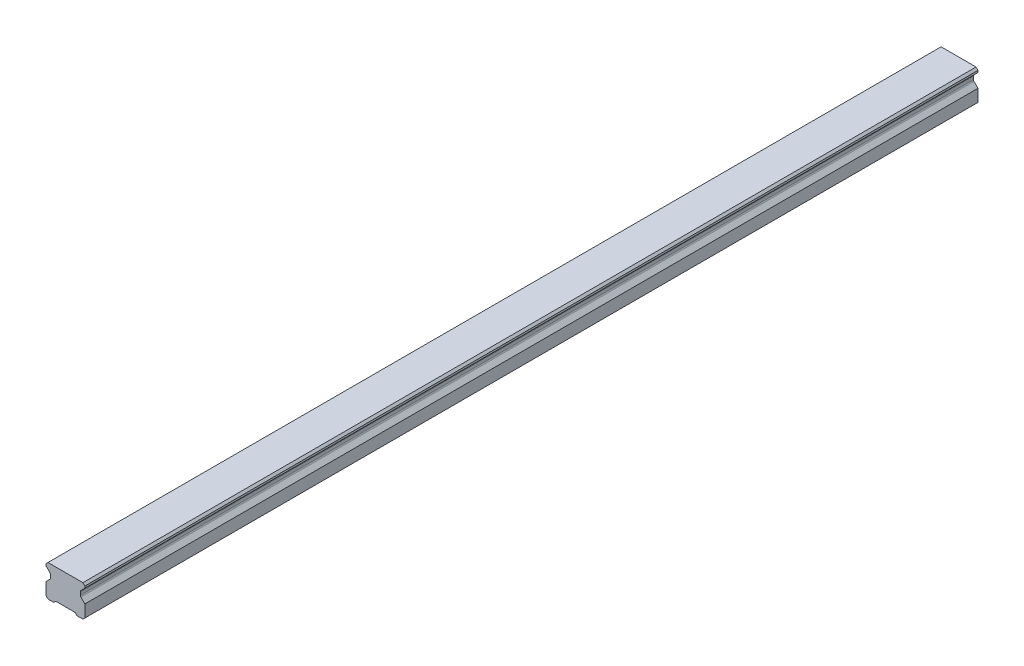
ISO-10303-21;
HEADER;
FILE_DESCRIPTION(('STEP AP214'),'2;1');
FILE_NAME('part.step','',(''),(''),'','','');
FILE_SCHEMA(('AUTOMOTIVE_DESIGN { 1 0 10303 214 1 1 1 1 }'));
ENDSEC;
DATA;
#1=APPLICATION_CONTEXT('core data for automotive mechanical design processes');
#2=APPLICATION_PROTOCOL_DEFINITION('international standard','automotive_design',2000,#1);
#3=PRODUCT_CONTEXT('',#1,'mechanical');
#4=PRODUCT('Part','Part','',(#3));
#5=PRODUCT_RELATED_PRODUCT_CATEGORY('part','',(#4));
#6=PRODUCT_DEFINITION_FORMATION('','',#4);
#7=PRODUCT_DEFINITION_CONTEXT('part definition',#1,'design');
#8=PRODUCT_DEFINITION('design','',#6,#7);
#9=PRODUCT_DEFINITION_SHAPE('','',#8);
#10=(LENGTH_UNIT() NAMED_UNIT(*) SI_UNIT(.MILLI.,.METRE.));
#11=(NAMED_UNIT(*) PLANE_ANGLE_UNIT() SI_UNIT($,.RADIAN.));
#12=(NAMED_UNIT(*) SI_UNIT($,.STERADIAN.) SOLID_ANGLE_UNIT());
#13=UNCERTAINTY_MEASURE_WITH_UNIT(LENGTH_MEASURE(1.E-05),#10,'distance_accuracy_value','');
#14=(GEOMETRIC_REPRESENTATION_CONTEXT(3) GLOBAL_UNCERTAINTY_ASSIGNED_CONTEXT((#13)) GLOBAL_UNIT_ASSIGNED_CONTEXT((#10,
#11,#12)) REPRESENTATION_CONTEXT('',''));
#15=CARTESIAN_POINT('',(0.,0.,0.));
#16=DIRECTION('',(0.,0.,1.));
#17=DIRECTION('',(1.,0.,0.));
#18=AXIS2_PLACEMENT_3D('',#15,#16,#17);
#19=CARTESIAN_POINT('',(0.,11.,-210.));
#20=DIRECTION('',(0.,-1.,0.));
#21=DIRECTION('',(0.,0.,-1.));
#22=AXIS2_PLACEMENT_3D('',#19,#20,#21);
#23=PLANE('',#22);
#24=CARTESIAN_POINT('',(0.,11.,-210.));
#25=DIRECTION('',(0.,-1.,0.));
#26=DIRECTION('',(0.,0.,-1.));
#27=AXIS2_PLACEMENT_3D('',#24,#25,#26);
#28=CIRCLE('',#27,2.5);
#29=CARTESIAN_POINT('',(0.,11.,-212.5));
#30=VERTEX_POINT('',#29);
#31=EDGE_CURVE('E42',#30,#30,#28,.T.);
#32=ORIENTED_EDGE('',*,*,#31,.F.);
#33=EDGE_LOOP('',(#32));
#34=FACE_BOUND('',#33,.T.);
#35=CARTESIAN_POINT('',(0.,11.,-210.));
#36=DIRECTION('',(0.,-1.,0.));
#37=DIRECTION('',(0.,0.,-1.));
#38=AXIS2_PLACEMENT_3D('',#35,#36,#37);
#39=CIRCLE('',#38,3.);
#40=CARTESIAN_POINT('',(0.,11.,-213.));
#41=VERTEX_POINT('',#40);
#42=EDGE_CURVE('E11',#41,#41,#39,.T.);
#43=ORIENTED_EDGE('',*,*,#42,.T.);
#44=EDGE_LOOP('',(#43));
#45=FACE_BOUND('',#44,.T.);
#46=ADVANCED_FACE('F39',(#34,#45),#23,.T.);
#47=CARTESIAN_POINT('',(0.,11.,-210.));
#48=DIRECTION('',(0.,-1.,0.));
#49=DIRECTION('',(0.,0.,-1.));
#50=AXIS2_PLACEMENT_3D('',#47,#48,#49);
#51=CYLINDRICAL_SURFACE('',#50,3.);
#52=ORIENTED_EDGE('',*,*,#42,.F.);
#53=EDGE_LOOP('',(#52));
#54=FACE_BOUND('',#53,.T.);
#55=CARTESIAN_POINT('',(0.,1.,-210.));
#56=DIRECTION('',(0.,-1.,0.));
#57=DIRECTION('',(0.,0.,-1.));
#58=AXIS2_PLACEMENT_3D('',#55,#56,#57);
#59=CIRCLE('',#58,3.);
#60=CARTESIAN_POINT('',(0.,1.,-213.));
#61=VERTEX_POINT('',#60);
#62=EDGE_CURVE('E48',#61,#61,#59,.T.);
#63=ORIENTED_EDGE('',*,*,#62,.T.);
#64=EDGE_LOOP('',(#63));
#65=FACE_BOUND('',#64,.T.);
#66=ADVANCED_FACE('F597',(#54,#65),#51,.F.);
#67=CARTESIAN_POINT('',(0.,11.,-150.));
#68=DIRECTION('',(0.,-1.,0.));
#69=DIRECTION('',(0.,0.,-1.));
#70=AXIS2_PLACEMENT_3D('',#67,#68,#69);
#71=PLANE('',#70);
#72=CARTESIAN_POINT('',(0.,11.,-150.));
#73=DIRECTION('',(0.,-1.,0.));
#74=DIRECTION('',(0.,0.,-1.));
#75=AXIS2_PLACEMENT_3D('',#72,#73,#74);
#76=CIRCLE('',#75,2.5);
#77=CARTESIAN_POINT('',(0.,11.,-152.5));
#78=VERTEX_POINT('',#77);
#79=EDGE_CURVE('E582',#78,#78,#76,.T.);
#80=ORIENTED_EDGE('',*,*,#79,.F.);
#81=EDGE_LOOP('',(#80));
#82=FACE_BOUND('',#81,.T.);
#83=CARTESIAN_POINT('',(0.,11.,-150.));
#84=DIRECTION('',(0.,-1.,0.));
#85=DIRECTION('',(0.,0.,-1.));
#86=AXIS2_PLACEMENT_3D('',#83,#84,#85);
#87=CIRCLE('',#86,3.);
#88=CARTESIAN_POINT('',(0.,11.,-153.));
#89=VERTEX_POINT('',#88);
#90=EDGE_CURVE('E561',#89,#89,#87,.T.);
#91=ORIENTED_EDGE('',*,*,#90,.T.);
#92=EDGE_LOOP('',(#91));
#93=FACE_BOUND('',#92,.T.);
#94=ADVANCED_FACE('F602',(#82,#93),#71,.T.);
#95=CARTESIAN_POINT('',(0.,11.,-150.));
#96=DIRECTION('',(0.,-1.,0.));
#97=DIRECTION('',(0.,0.,-1.));
#98=AXIS2_PLACEMENT_3D('',#95,#96,#97);
#99=CYLINDRICAL_SURFACE('',#98,3.);
#100=ORIENTED_EDGE('',*,*,#90,.F.);
#101=EDGE_LOOP('',(#100));
#102=FACE_BOUND('',#101,.T.);
#103=CARTESIAN_POINT('',(0.,1.,-150.));
#104=DIRECTION('',(0.,-1.,0.));
#105=DIRECTION('',(0.,0.,-1.));
#106=AXIS2_PLACEMENT_3D('',#103,#104,#105);
#107=CIRCLE('',#106,3.);
#108=CARTESIAN_POINT('',(0.,1.,-153.));
#109=VERTEX_POINT('',#108);
#110=EDGE_CURVE('E557',#109,#109,#107,.T.);
#111=ORIENTED_EDGE('',*,*,#110,.T.);
#112=EDGE_LOOP('',(#111));
#113=FACE_BOUND('',#112,.T.);
#114=ADVANCED_FACE('F737',(#102,#113),#99,.F.);
#115=CARTESIAN_POINT('',(0.,11.,-90.));
#116=DIRECTION('',(0.,-1.,0.));
#117=DIRECTION('',(0.,0.,-1.));
#118=AXIS2_PLACEMENT_3D('',#115,#116,#117);
#119=PLANE('',#118);
#120=CARTESIAN_POINT('',(0.,11.,-90.));
#121=DIRECTION('',(0.,-1.,0.));
#122=DIRECTION('',(0.,0.,-1.));
#123=AXIS2_PLACEMENT_3D('',#120,#121,#122);
#124=CIRCLE('',#123,2.5);
#125=CARTESIAN_POINT('',(0.,11.,-92.5));
#126=VERTEX_POINT('',#125);
#127=EDGE_CURVE('E579',#126,#126,#124,.T.);
#128=ORIENTED_EDGE('',*,*,#127,.F.);
#129=EDGE_LOOP('',(#128));
#130=FACE_BOUND('',#129,.T.);
#131=CARTESIAN_POINT('',(0.,11.,-90.));
#132=DIRECTION('',(0.,-1.,0.));
#133=DIRECTION('',(0.,0.,-1.));
#134=AXIS2_PLACEMENT_3D('',#131,#132,#133);
#135=CIRCLE('',#134,3.);
#136=CARTESIAN_POINT('',(0.,11.,-93.));
#137=VERTEX_POINT('',#136);
#138=EDGE_CURVE('E553',#137,#137,#135,.T.);
#139=ORIENTED_EDGE('',*,*,#138,.T.);
#140=EDGE_LOOP('',(#139));
#141=FACE_BOUND('',#140,.T.);
#142=ADVANCED_FACE('F733',(#130,#141),#119,.T.);
#143=CARTESIAN_POINT('',(0.,11.,-90.));
#144=DIRECTION('',(0.,-1.,0.));
#145=DIRECTION('',(0.,0.,-1.));
#146=AXIS2_PLACEMENT_3D('',#143,#144,#145);
#147=CYLINDRICAL_SURFACE('',#146,3.);
#148=ORIENTED_EDGE('',*,*,#138,.F.);
#149=EDGE_LOOP('',(#148));
#150=FACE_BOUND('',#149,.T.);
#151=CARTESIAN_POINT('',(0.,1.,-90.));
#152=DIRECTION('',(0.,-1.,0.));
#153=DIRECTION('',(0.,0.,-1.));
#154=AXIS2_PLACEMENT_3D('',#151,#152,#153);
#155=CIRCLE('',#154,3.);
#156=CARTESIAN_POINT('',(0.,1.,-93.));
#157=VERTEX_POINT('',#156);
#158=EDGE_CURVE('E549',#157,#157,#155,.T.);
#159=ORIENTED_EDGE('',*,*,#158,.T.);
#160=EDGE_LOOP('',(#159));
#161=FACE_BOUND('',#160,.T.);
#162=ADVANCED_FACE('F729',(#150,#161),#147,.F.);
#163=CARTESIAN_POINT('',(0.,11.,-30.));
#164=DIRECTION('',(0.,-1.,0.));
#165=DIRECTION('',(0.,0.,-1.));
#166=AXIS2_PLACEMENT_3D('',#163,#164,#165);
#167=PLANE('',#166);
#168=CARTESIAN_POINT('',(0.,11.,-30.));
#169=DIRECTION('',(0.,-1.,0.));
#170=DIRECTION('',(0.,0.,-1.));
#171=AXIS2_PLACEMENT_3D('',#168,#169,#170);
#172=CIRCLE('',#171,2.5);
#173=CARTESIAN_POINT('',(0.,11.,-32.5));
#174=VERTEX_POINT('',#173);
#175=EDGE_CURVE('E575',#174,#174,#172,.T.);
#176=ORIENTED_EDGE('',*,*,#175,.F.);
#177=EDGE_LOOP('',(#176));
#178=FACE_BOUND('',#177,.T.);
#179=CARTESIAN_POINT('',(0.,11.,-30.));
#180=DIRECTION('',(0.,-1.,0.));
#181=DIRECTION('',(0.,0.,-1.));
#182=AXIS2_PLACEMENT_3D('',#179,#180,#181);
#183=CIRCLE('',#182,3.);
#184=CARTESIAN_POINT('',(0.,11.,-33.));
#185=VERTEX_POINT('',#184);
#186=EDGE_CURVE('E545',#185,#185,#183,.T.);
#187=ORIENTED_EDGE('',*,*,#186,.T.);
#188=EDGE_LOOP('',(#187));
#189=FACE_BOUND('',#188,.T.);
#190=ADVANCED_FACE('F725',(#178,#189),#167,.T.);
#191=CARTESIAN_POINT('',(0.,11.,-30.));
#192=DIRECTION('',(0.,-1.,0.));
#193=DIRECTION('',(0.,0.,-1.));
#194=AXIS2_PLACEMENT_3D('',#191,#192,#193);
#195=CYLINDRICAL_SURFACE('',#194,3.);
#196=ORIENTED_EDGE('',*,*,#186,.F.);
#197=EDGE_LOOP('',(#196));
#198=FACE_BOUND('',#197,.T.);
#199=CARTESIAN_POINT('',(0.,1.,-30.));
#200=DIRECTION('',(0.,-1.,0.));
#201=DIRECTION('',(0.,0.,-1.));
#202=AXIS2_PLACEMENT_3D('',#199,#200,#201);
#203=CIRCLE('',#202,3.);
#204=CARTESIAN_POINT('',(0.,1.,-33.));
#205=VERTEX_POINT('',#204);
#206=EDGE_CURVE('E541',#205,#205,#203,.T.);
#207=ORIENTED_EDGE('',*,*,#206,.T.);
#208=EDGE_LOOP('',(#207));
#209=FACE_BOUND('',#208,.T.);
#210=ADVANCED_FACE('F721',(#198,#209),#195,.F.);
#211=CARTESIAN_POINT('',(0.,11.,30.));
#212=DIRECTION('',(0.,-1.,0.));
#213=DIRECTION('',(0.,0.,-1.));
#214=AXIS2_PLACEMENT_3D('',#211,#212,#213);
#215=PLANE('',#214);
#216=CARTESIAN_POINT('',(0.,11.,30.));
#217=DIRECTION('',(0.,-1.,0.));
#218=DIRECTION('',(0.,0.,-1.));
#219=AXIS2_PLACEMENT_3D('',#216,#217,#218);
#220=CIRCLE('',#219,2.5);
#221=CARTESIAN_POINT('',(0.,11.,27.5));
#222=VERTEX_POINT('',#221);
#223=EDGE_CURVE('E571',#222,#222,#220,.T.);
#224=ORIENTED_EDGE('',*,*,#223,.F.);
#225=EDGE_LOOP('',(#224));
#226=FACE_BOUND('',#225,.T.);
#227=CARTESIAN_POINT('',(0.,11.,30.));
#228=DIRECTION('',(0.,-1.,0.));
#229=DIRECTION('',(0.,0.,-1.));
#230=AXIS2_PLACEMENT_3D('',#227,#228,#229);
#231=CIRCLE('',#230,3.);
#232=CARTESIAN_POINT('',(0.,11.,27.));
#233=VERTEX_POINT('',#232);
#234=EDGE_CURVE('E537',#233,#233,#231,.T.);
#235=ORIENTED_EDGE('',*,*,#234,.T.);
#236=EDGE_LOOP('',(#235));
#237=FACE_BOUND('',#236,.T.);
#238=ADVANCED_FACE('F717',(#226,#237),#215,.T.);
#239=CARTESIAN_POINT('',(0.,11.,30.));
#240=DIRECTION('',(0.,-1.,0.));
#241=DIRECTION('',(0.,0.,-1.));
#242=AXIS2_PLACEMENT_3D('',#239,#240,#241);
#243=CYLINDRICAL_SURFACE('',#242,3.);
#244=ORIENTED_EDGE('',*,*,#234,.F.);
#245=EDGE_LOOP('',(#244));
#246=FACE_BOUND('',#245,.T.);
#247=CARTESIAN_POINT('',(0.,1.,30.));
#248=DIRECTION('',(0.,-1.,0.));
#249=DIRECTION('',(0.,0.,-1.));
#250=AXIS2_PLACEMENT_3D('',#247,#248,#249);
#251=CIRCLE('',#250,3.);
#252=CARTESIAN_POINT('',(0.,1.,27.));
#253=VERTEX_POINT('',#252);
#254=EDGE_CURVE('E533',#253,#253,#251,.T.);
#255=ORIENTED_EDGE('',*,*,#254,.T.);
#256=EDGE_LOOP('',(#255));
#257=FACE_BOUND('',#256,.T.);
#258=ADVANCED_FACE('F713',(#246,#257),#243,.F.);
#259=CARTESIAN_POINT('',(0.,11.,90.));
#260=DIRECTION('',(0.,-1.,0.));
#261=DIRECTION('',(0.,0.,-1.));
#262=AXIS2_PLACEMENT_3D('',#259,#260,#261);
#263=PLANE('',#262);
#264=CARTESIAN_POINT('',(0.,11.,90.));
#265=DIRECTION('',(0.,-1.,0.));
#266=DIRECTION('',(0.,0.,-1.));
#267=AXIS2_PLACEMENT_3D('',#264,#265,#266);
#268=CIRCLE('',#267,2.5);
#269=CARTESIAN_POINT('',(0.,11.,87.5));
#270=VERTEX_POINT('',#269);
#271=EDGE_CURVE('E242',#270,#270,#268,.T.);
#272=ORIENTED_EDGE('',*,*,#271,.F.);
#273=EDGE_LOOP('',(#272));
#274=FACE_BOUND('',#273,.T.);
#275=CARTESIAN_POINT('',(0.,11.,90.));
#276=DIRECTION('',(0.,-1.,0.));
#277=DIRECTION('',(0.,0.,-1.));
#278=AXIS2_PLACEMENT_3D('',#275,#276,#277);
#279=CIRCLE('',#278,3.);
#280=CARTESIAN_POINT('',(0.,11.,87.));
#281=VERTEX_POINT('',#280);
#282=EDGE_CURVE('E529',#281,#281,#279,.T.);
#283=ORIENTED_EDGE('',*,*,#282,.T.);
#284=EDGE_LOOP('',(#283));
#285=FACE_BOUND('',#284,.T.);
#286=ADVANCED_FACE('F709',(#274,#285),#263,.T.);
#287=CARTESIAN_POINT('',(0.,11.,90.));
#288=DIRECTION('',(0.,-1.,0.));
#289=DIRECTION('',(0.,0.,-1.));
#290=AXIS2_PLACEMENT_3D('',#287,#288,#289);
#291=CYLINDRICAL_SURFACE('',#290,3.);
#292=ORIENTED_EDGE('',*,*,#282,.F.);
#293=EDGE_LOOP('',(#292));
#294=FACE_BOUND('',#293,.T.);
#295=CARTESIAN_POINT('',(0.,1.,90.));
#296=DIRECTION('',(0.,-1.,0.));
#297=DIRECTION('',(0.,0.,-1.));
#298=AXIS2_PLACEMENT_3D('',#295,#296,#297);
#299=CIRCLE('',#298,3.);
#300=CARTESIAN_POINT('',(0.,1.,87.));
#301=VERTEX_POINT('',#300);
#302=EDGE_CURVE('E525',#301,#301,#299,.T.);
#303=ORIENTED_EDGE('',*,*,#302,.T.);
#304=EDGE_LOOP('',(#303));
#305=FACE_BOUND('',#304,.T.);
#306=ADVANCED_FACE('F706',(#294,#305),#291,.F.);
#307=CARTESIAN_POINT('',(10.,0.,230.));
#308=DIRECTION('',(0.,1.,0.));
#309=DIRECTION('',(-1.,0.,0.));
#310=AXIS2_PLACEMENT_3D('',#307,#308,#309);
#311=PLANE('',#310);
#312=DIRECTION('',(1.,0.,0.));
#313=VECTOR('',#312,1.);
#314=CARTESIAN_POINT('',(10.,0.,-230.));
#315=LINE('',#314,#313);
#316=CARTESIAN_POINT('',(-9.,0.,-230.));
#317=VERTEX_POINT('',#316);
#318=CARTESIAN_POINT('',(-6.,0.,-230.));
#319=VERTEX_POINT('',#318);
#320=EDGE_CURVE('E408',#317,#319,#315,.T.);
#321=ORIENTED_EDGE('',*,*,#320,.T.);
#322=DIRECTION('',(0.,0.,1.));
#323=VECTOR('',#322,1.);
#324=CARTESIAN_POINT('',(-6.,0.,-230.));
#325=LINE('',#324,#323);
#326=CARTESIAN_POINT('',(-6.,0.,230.));
#327=VERTEX_POINT('',#326);
#328=EDGE_CURVE('E313',#319,#327,#325,.T.);
#329=ORIENTED_EDGE('',*,*,#328,.T.);
#330=DIRECTION('',(1.,0.,0.));
#331=VECTOR('',#330,1.);
#332=CARTESIAN_POINT('',(10.,0.,230.));
#333=LINE('',#332,#331);
#334=CARTESIAN_POINT('',(-9.,0.,230.));
#335=VERTEX_POINT('',#334);
#336=EDGE_CURVE('E389',#335,#327,#333,.T.);
#337=ORIENTED_EDGE('',*,*,#336,.F.);
#338=DIRECTION('',(0.,0.,-1.));
#339=VECTOR('',#338,1.);
#340=CARTESIAN_POINT('',(-9.,0.,230.));
#341=LINE('',#340,#339);
#342=EDGE_CURVE('E460',#335,#317,#341,.T.);
#343=ORIENTED_EDGE('',*,*,#342,.T.);
#344=EDGE_LOOP('',(#321,#329,#337,#343));
#345=FACE_BOUND('',#344,.T.);
#346=ADVANCED_FACE('F671',(#345),#311,.F.);
#347=CARTESIAN_POINT('',(-10.,16.3,230.));
#348=DIRECTION('',(1.,0.,0.));
#349=DIRECTION('',(0.,1.,0.));
#350=AXIS2_PLACEMENT_3D('',#347,#348,#349);
#351=PLANE('',#350);
#352=DIRECTION('',(0.,-1.,0.));
#353=VECTOR('',#352,1.);
#354=CARTESIAN_POINT('',(-10.,16.3,230.));
#355=LINE('',#354,#353);
#356=CARTESIAN_POINT('',(-10.,15.3,230.));
#357=VERTEX_POINT('',#356);
#358=CARTESIAN_POINT('',(-10.,14.3,230.));
#359=VERTEX_POINT('',#358);
#360=EDGE_CURVE('E383',#357,#359,#355,.T.);
#361=ORIENTED_EDGE('',*,*,#360,.F.);
#362=DIRECTION('',(0.,0.,-1.));
#363=VECTOR('',#362,1.);
#364=CARTESIAN_POINT('',(-10.,15.3,230.));
#365=LINE('',#364,#363);
#366=CARTESIAN_POINT('',(-10.,15.3,-230.));
#367=VERTEX_POINT('',#366);
#368=EDGE_CURVE('E402',#357,#367,#365,.T.);
#369=ORIENTED_EDGE('',*,*,#368,.T.);
#370=DIRECTION('',(0.,-1.,0.));
#371=VECTOR('',#370,1.);
#372=CARTESIAN_POINT('',(-10.,16.3,-230.));
#373=LINE('',#372,#371);
#374=CARTESIAN_POINT('',(-10.,14.3,-230.));
#375=VERTEX_POINT('',#374);
#376=EDGE_CURVE('E403',#367,#375,#373,.T.);
#377=ORIENTED_EDGE('',*,*,#376,.T.);
#378=DIRECTION('',(0.,0.,1.));
#379=VECTOR('',#378,1.);
#380=CARTESIAN_POINT('',(-10.,14.3,-230.));
#381=LINE('',#380,#379);
#382=EDGE_CURVE('E337',#375,#359,#381,.T.);
#383=ORIENTED_EDGE('',*,*,#382,.T.);
#384=EDGE_LOOP('',(#361,#369,#377,#383));
#385=FACE_BOUND('',#384,.T.);
#386=ADVANCED_FACE('F675',(#385),#351,.F.);
#387=CARTESIAN_POINT('',(10.,16.3,230.));
#388=DIRECTION('',(-1.,0.,0.));
#389=DIRECTION('',(0.,-1.,0.));
#390=AXIS2_PLACEMENT_3D('',#387,#388,#389);
#391=PLANE('',#390);
#392=DIRECTION('',(0.,1.,0.));
#393=VECTOR('',#392,1.);
#394=CARTESIAN_POINT('',(10.,16.3,230.));
#395=LINE('',#394,#393);
#396=CARTESIAN_POINT('',(10.,1.,230.));
#397=VERTEX_POINT('',#396);
#398=CARTESIAN_POINT('',(10.,7.3,230.));
#399=VERTEX_POINT('',#398);
#400=EDGE_CURVE('E394',#397,#399,#395,.T.);
#401=ORIENTED_EDGE('',*,*,#400,.F.);
#402=DIRECTION('',(0.,0.,-1.));
#403=VECTOR('',#402,1.);
#404=CARTESIAN_POINT('',(10.,1.,230.));
#405=LINE('',#404,#403);
#406=CARTESIAN_POINT('',(10.,1.,-230.));
#407=VERTEX_POINT('',#406);
#408=EDGE_CURVE('E467',#397,#407,#405,.T.);
#409=ORIENTED_EDGE('',*,*,#408,.T.);
#410=DIRECTION('',(0.,1.,0.));
#411=VECTOR('',#410,1.);
#412=CARTESIAN_POINT('',(10.,16.3,-230.));
#413=LINE('',#412,#411);
#414=CARTESIAN_POINT('',(10.,7.3,-230.));
#415=VERTEX_POINT('',#414);
#416=EDGE_CURVE('E413',#407,#415,#413,.T.);
#417=ORIENTED_EDGE('',*,*,#416,.T.);
#418=DIRECTION('',(0.,0.,1.));
#419=VECTOR('',#418,1.);
#420=CARTESIAN_POINT('',(10.,7.3,-230.));
#421=LINE('',#420,#419);
#422=EDGE_CURVE('E368',#415,#399,#421,.T.);
#423=ORIENTED_EDGE('',*,*,#422,.T.);
#424=EDGE_LOOP('',(#401,#409,#417,#423));
#425=FACE_BOUND('',#424,.T.);
#426=ADVANCED_FACE('F666',(#425),#391,.F.);
#427=CARTESIAN_POINT('',(-10.,7.3,-230.));
#428=VERTEX_POINT('',#427);
#429=CARTESIAN_POINT('',(-10.,0.999999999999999,-230.));
#430=VERTEX_POINT('',#429);
#431=EDGE_CURVE('E352',#428,#430,#373,.T.);
#432=ORIENTED_EDGE('',*,*,#431,.T.);
#433=DIRECTION('',(0.,0.,1.));
#434=VECTOR('',#433,1.);
#435=CARTESIAN_POINT('',(-10.,0.999999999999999,230.));
#436=LINE('',#435,#434);
#437=CARTESIAN_POINT('',(-10.,0.999999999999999,230.));
#438=VERTEX_POINT('',#437);
#439=EDGE_CURVE('E464',#430,#438,#436,.T.);
#440=ORIENTED_EDGE('',*,*,#439,.T.);
#441=CARTESIAN_POINT('',(-10.,7.3,230.));
#442=VERTEX_POINT('',#441);
#443=EDGE_CURVE('E388',#442,#438,#355,.T.);
#444=ORIENTED_EDGE('',*,*,#443,.F.);
#445=DIRECTION('',(0.,0.,1.));
#446=VECTOR('',#445,1.);
#447=CARTESIAN_POINT('',(-10.,7.3,-230.));
#448=LINE('',#447,#446);
#449=EDGE_CURVE('E349',#428,#442,#448,.T.);
#450=ORIENTED_EDGE('',*,*,#449,.F.);
#451=EDGE_LOOP('',(#432,#440,#444,#450));
#452=FACE_BOUND('',#451,.T.);
#453=ADVANCED_FACE('F669',(#452),#351,.F.);
#454=CARTESIAN_POINT('',(6.,0.,230.));
#455=VERTEX_POINT('',#454);
#456=CARTESIAN_POINT('',(9.,0.,230.));
#457=VERTEX_POINT('',#456);
#458=EDGE_CURVE('E387',#455,#457,#333,.T.);
#459=ORIENTED_EDGE('',*,*,#458,.F.);
#460=DIRECTION('',(0.,0.,1.));
#461=VECTOR('',#460,1.);
#462=CARTESIAN_POINT('',(6.,0.,-230.));
#463=LINE('',#462,#461);
#464=CARTESIAN_POINT('',(6.,0.,-230.));
#465=VERTEX_POINT('',#464);
#466=EDGE_CURVE('E303',#465,#455,#463,.T.);
#467=ORIENTED_EDGE('',*,*,#466,.F.);
#468=CARTESIAN_POINT('',(9.,0.,-230.));
#469=VERTEX_POINT('',#468);
#470=EDGE_CURVE('E407',#465,#469,#315,.T.);
#471=ORIENTED_EDGE('',*,*,#470,.T.);
#472=DIRECTION('',(0.,0.,1.));
#473=VECTOR('',#472,1.);
#474=CARTESIAN_POINT('',(9.,0.,230.));
#475=LINE('',#474,#473);
#476=EDGE_CURVE('E456',#469,#457,#475,.T.);
#477=ORIENTED_EDGE('',*,*,#476,.T.);
#478=EDGE_LOOP('',(#459,#467,#471,#477));
#479=FACE_BOUND('',#478,.T.);
#480=ADVANCED_FACE('F664',(#479),#311,.F.);
#481=CARTESIAN_POINT('',(10.,14.3,-230.));
#482=VERTEX_POINT('',#481);
#483=CARTESIAN_POINT('',(10.,15.3,-230.));
#484=VERTEX_POINT('',#483);
#485=EDGE_CURVE('E412',#482,#484,#413,.T.);
#486=ORIENTED_EDGE('',*,*,#485,.T.);
#487=DIRECTION('',(0.,0.,1.));
#488=VECTOR('',#487,1.);
#489=CARTESIAN_POINT('',(10.,15.3,230.));
#490=LINE('',#489,#488);
#491=CARTESIAN_POINT('',(10.,15.3,230.));
#492=VERTEX_POINT('',#491);
#493=EDGE_CURVE('E471',#484,#492,#490,.T.);
#494=ORIENTED_EDGE('',*,*,#493,.T.);
#495=CARTESIAN_POINT('',(10.,14.3,230.));
#496=VERTEX_POINT('',#495);
#497=EDGE_CURVE('E393',#496,#492,#395,.T.);
#498=ORIENTED_EDGE('',*,*,#497,.F.);
#499=DIRECTION('',(0.,0.,1.));
#500=VECTOR('',#499,1.);
#501=CARTESIAN_POINT('',(10.,14.3,-230.));
#502=LINE('',#501,#500);
#503=EDGE_CURVE('E342',#482,#496,#502,.T.);
#504=ORIENTED_EDGE('',*,*,#503,.F.);
#505=EDGE_LOOP('',(#486,#494,#498,#504));
#506=FACE_BOUND('',#505,.T.);
#507=ADVANCED_FACE('F660',(#506),#391,.F.);
#508=CARTESIAN_POINT('',(10.,16.3,230.));
#509=DIRECTION('',(0.,-1.,0.));
#510=DIRECTION('',(0.,0.,-1.));
#511=AXIS2_PLACEMENT_3D('',#508,#509,#510);
#512=PLANE('',#511);
#513=DIRECTION('',(-1.,0.,0.));
#514=VECTOR('',#513,1.);
#515=CARTESIAN_POINT('',(10.,16.3,-230.));
#516=LINE('',#515,#514);
#517=CARTESIAN_POINT('',(9.00000000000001,16.3,-230.));
#518=VERTEX_POINT('',#517);
#519=CARTESIAN_POINT('',(-9.,16.3,-230.));
#520=VERTEX_POINT('',#519);
#521=EDGE_CURVE('E417',#518,#520,#516,.T.);
#522=ORIENTED_EDGE('',*,*,#521,.T.);
#523=DIRECTION('',(0.,0.,1.));
#524=VECTOR('',#523,1.);
#525=CARTESIAN_POINT('',(-9.,16.3,230.));
#526=LINE('',#525,#524);
#527=CARTESIAN_POINT('',(-9.,16.3,230.));
#528=VERTEX_POINT('',#527);
#529=EDGE_CURVE('E441',#520,#528,#526,.T.);
#530=ORIENTED_EDGE('',*,*,#529,.T.);
#531=DIRECTION('',(-1.,0.,0.));
#532=VECTOR('',#531,1.);
#533=CARTESIAN_POINT('',(10.,16.3,230.));
#534=LINE('',#533,#532);
#535=CARTESIAN_POINT('',(9.00000000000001,16.3,230.));
#536=VERTEX_POINT('',#535);
#537=EDGE_CURVE('E398',#536,#528,#534,.T.);
#538=ORIENTED_EDGE('',*,*,#537,.F.);
#539=DIRECTION('',(0.,0.,-1.));
#540=VECTOR('',#539,1.);
#541=CARTESIAN_POINT('',(9.00000000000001,16.3,230.));
#542=LINE('',#541,#540);
#543=EDGE_CURVE('E437',#536,#518,#542,.T.);
#544=ORIENTED_EDGE('',*,*,#543,.T.);
#545=EDGE_LOOP('',(#522,#530,#538,#544));
#546=FACE_BOUND('',#545,.T.);
#547=ADVANCED_FACE('F654',(#546),#512,.F.);
#548=CARTESIAN_POINT('',(0.,0.,230.));
#549=DIRECTION('',(0.,0.,-1.));
#550=DIRECTION('',(-1.,0.,0.));
#551=AXIS2_PLACEMENT_3D('',#548,#549,#550);
#552=PLANE('',#551);
#553=ORIENTED_EDGE('',*,*,#336,.T.);
#554=DIRECTION('',(-0.707106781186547,-0.707106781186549,0.));
#555=VECTOR('',#554,1.);
#556=CARTESIAN_POINT('',(-6.,0.,230.));
#557=LINE('',#556,#555);
#558=CARTESIAN_POINT('',(-5.,1.,230.));
#559=VERTEX_POINT('',#558);
#560=EDGE_CURVE('E296',#559,#327,#557,.T.);
#561=ORIENTED_EDGE('',*,*,#560,.F.);
#562=DIRECTION('',(-1.,0.,0.));
#563=VECTOR('',#562,1.);
#564=CARTESIAN_POINT('',(-5.,1.,230.));
#565=LINE('',#564,#563);
#566=CARTESIAN_POINT('',(5.,1.,230.));
#567=VERTEX_POINT('',#566);
#568=EDGE_CURVE('E307',#567,#559,#565,.T.);
#569=ORIENTED_EDGE('',*,*,#568,.F.);
#570=DIRECTION('',(-0.707106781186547,0.707106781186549,0.));
#571=VECTOR('',#570,1.);
#572=CARTESIAN_POINT('',(5.,1.,230.));
#573=LINE('',#572,#571);
#574=EDGE_CURVE('E288',#455,#567,#573,.T.);
#575=ORIENTED_EDGE('',*,*,#574,.F.);
#576=ORIENTED_EDGE('',*,*,#458,.T.);
#577=DIRECTION('',(-0.707106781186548,-0.707106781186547,0.));
#578=VECTOR('',#577,1.);
#579=CARTESIAN_POINT('',(10.,1.,230.));
#580=LINE('',#579,#578);
#581=EDGE_CURVE('E447',#457,#397,#580,.F.);
#582=ORIENTED_EDGE('',*,*,#581,.T.);
#583=ORIENTED_EDGE('',*,*,#400,.T.);
#584=DIRECTION('',(0.707106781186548,-0.707106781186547,0.));
#585=VECTOR('',#584,1.);
#586=CARTESIAN_POINT('',(10.,7.3,230.));
#587=LINE('',#586,#585);
#588=CARTESIAN_POINT('',(7.95955988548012,9.34044011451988,230.));
#589=VERTEX_POINT('',#588);
#590=EDGE_CURVE('E317',#589,#399,#587,.T.);
#591=ORIENTED_EDGE('',*,*,#590,.F.);
#592=CARTESIAN_POINT('',(8.66666666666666,10.0475468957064,230.));
#593=DIRECTION('',(0.,0.,-1.));
#594=DIRECTION('',(-1.,0.,0.));
#595=AXIS2_PLACEMENT_3D('',#592,#593,#594);
#596=CIRCLE('',#595,1.);
#597=CARTESIAN_POINT('',(7.66666666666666,10.0475468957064,230.));
#598=VERTEX_POINT('',#597);
#599=EDGE_CURVE('E502',#589,#598,#596,.T.);
#600=ORIENTED_EDGE('',*,*,#599,.T.);
#601=DIRECTION('',(0.,-1.,0.));
#602=VECTOR('',#601,1.);
#603=CARTESIAN_POINT('',(7.66666666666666,9.63333333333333,230.));
#604=LINE('',#603,#602);
#605=CARTESIAN_POINT('',(7.66666666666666,11.5524531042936,230.));
#606=VERTEX_POINT('',#605);
#607=EDGE_CURVE('E360',#606,#598,#604,.T.);
#608=ORIENTED_EDGE('',*,*,#607,.F.);
#609=CARTESIAN_POINT('',(8.66666666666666,11.5524531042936,230.));
#610=DIRECTION('',(0.,0.,-1.));
#611=DIRECTION('',(-1.,0.,0.));
#612=AXIS2_PLACEMENT_3D('',#609,#610,#611);
#613=CIRCLE('',#612,1.);
#614=CARTESIAN_POINT('',(7.95955988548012,12.2595598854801,230.));
#615=VERTEX_POINT('',#614);
#616=EDGE_CURVE('E508',#606,#615,#613,.T.);
#617=ORIENTED_EDGE('',*,*,#616,.T.);
#618=DIRECTION('',(-0.707106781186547,-0.707106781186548,0.));
#619=VECTOR('',#618,1.);
#620=CARTESIAN_POINT('',(7.66666666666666,11.9666666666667,230.));
#621=LINE('',#620,#619);
#622=EDGE_CURVE('E371',#496,#615,#621,.T.);
#623=ORIENTED_EDGE('',*,*,#622,.F.);
#624=ORIENTED_EDGE('',*,*,#497,.T.);
#625=DIRECTION('',(0.707106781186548,-0.707106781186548,0.));
#626=VECTOR('',#625,1.);
#627=CARTESIAN_POINT('',(9.00000000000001,16.3,230.));
#628=LINE('',#627,#626);
#629=EDGE_CURVE('E444',#492,#536,#628,.F.);
#630=ORIENTED_EDGE('',*,*,#629,.T.);
#631=ORIENTED_EDGE('',*,*,#537,.T.);
#632=DIRECTION('',(0.707106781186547,0.707106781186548,0.));
#633=VECTOR('',#632,1.);
#634=CARTESIAN_POINT('',(-10.,15.3,230.));
#635=LINE('',#634,#633);
#636=EDGE_CURVE('E453',#528,#357,#635,.F.);
#637=ORIENTED_EDGE('',*,*,#636,.T.);
#638=ORIENTED_EDGE('',*,*,#360,.T.);
#639=DIRECTION('',(-0.707106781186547,0.707106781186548,0.));
#640=VECTOR('',#639,1.);
#641=CARTESIAN_POINT('',(-7.66666666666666,11.9666666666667,230.));
#642=LINE('',#641,#640);
#643=CARTESIAN_POINT('',(-7.95955988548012,12.2595598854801,230.));
#644=VERTEX_POINT('',#643);
#645=EDGE_CURVE('E338',#644,#359,#642,.T.);
#646=ORIENTED_EDGE('',*,*,#645,.F.);
#647=CARTESIAN_POINT('',(-8.66666666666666,11.5524531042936,230.));
#648=DIRECTION('',(0.,0.,-1.));
#649=DIRECTION('',(-1.,0.,0.));
#650=AXIS2_PLACEMENT_3D('',#647,#648,#649);
#651=CIRCLE('',#650,1.);
#652=CARTESIAN_POINT('',(-7.66666666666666,11.5524531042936,230.));
#653=VERTEX_POINT('',#652);
#654=EDGE_CURVE('E520',#644,#653,#651,.T.);
#655=ORIENTED_EDGE('',*,*,#654,.T.);
#656=DIRECTION('',(0.,1.,0.));
#657=VECTOR('',#656,1.);
#658=CARTESIAN_POINT('',(-7.66666666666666,9.63333333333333,230.));
#659=LINE('',#658,#657);
#660=CARTESIAN_POINT('',(-7.66666666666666,10.0475468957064,230.));
#661=VERTEX_POINT('',#660);
#662=EDGE_CURVE('E330',#661,#653,#659,.T.);
#663=ORIENTED_EDGE('',*,*,#662,.F.);
#664=CARTESIAN_POINT('',(-8.66666666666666,10.0475468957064,230.));
#665=DIRECTION('',(0.,0.,-1.));
#666=DIRECTION('',(-1.,0.,0.));
#667=AXIS2_PLACEMENT_3D('',#664,#665,#666);
#668=CIRCLE('',#667,1.);
#669=CARTESIAN_POINT('',(-7.95955988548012,9.34044011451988,230.));
#670=VERTEX_POINT('',#669);
#671=EDGE_CURVE('E514',#661,#670,#668,.T.);
#672=ORIENTED_EDGE('',*,*,#671,.T.);
#673=DIRECTION('',(0.707106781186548,0.707106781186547,0.));
#674=VECTOR('',#673,1.);
#675=CARTESIAN_POINT('',(-10.,7.3,230.));
#676=LINE('',#675,#674);
#677=EDGE_CURVE('E341',#442,#670,#676,.T.);
#678=ORIENTED_EDGE('',*,*,#677,.F.);
#679=ORIENTED_EDGE('',*,*,#443,.T.);
#680=DIRECTION('',(-0.707106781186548,0.707106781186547,0.));
#681=VECTOR('',#680,1.);
#682=CARTESIAN_POINT('',(-9.,0.,230.));
#683=LINE('',#682,#681);
#684=EDGE_CURVE('E450',#438,#335,#683,.F.);
#685=ORIENTED_EDGE('',*,*,#684,.T.);
#686=EDGE_LOOP('',(#553,#561,#569,#575,#576,#582,#583,#591,#600,#608,#617,#623,#624,#630,#631,
#637,#638,#646,#655,#663,#672,#678,#679,#685));
#687=FACE_BOUND('',#686,.T.);
#688=ADVANCED_FACE('F651',(#687),#552,.F.);
#689=CARTESIAN_POINT('',(0.,0.,-230.));
#690=DIRECTION('',(0.,0.,-1.));
#691=DIRECTION('',(-1.,0.,0.));
#692=AXIS2_PLACEMENT_3D('',#689,#690,#691);
#693=PLANE('',#692);
#694=DIRECTION('',(-0.707106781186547,-0.707106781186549,0.));
#695=VECTOR('',#694,1.);
#696=CARTESIAN_POINT('',(-6.,0.,-230.));
#697=LINE('',#696,#695);
#698=CARTESIAN_POINT('',(-5.,1.,-230.));
#699=VERTEX_POINT('',#698);
#700=EDGE_CURVE('E299',#699,#319,#697,.T.);
#701=ORIENTED_EDGE('',*,*,#700,.T.);
#702=ORIENTED_EDGE('',*,*,#320,.F.);
#703=DIRECTION('',(0.707106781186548,-0.707106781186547,0.));
#704=VECTOR('',#703,1.);
#705=CARTESIAN_POINT('',(-4.49999999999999,-4.5,-230.));
#706=LINE('',#705,#704);
#707=EDGE_CURVE('E431',#317,#430,#706,.F.);
#708=ORIENTED_EDGE('',*,*,#707,.T.);
#709=ORIENTED_EDGE('',*,*,#431,.F.);
#710=DIRECTION('',(0.707106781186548,0.707106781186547,0.));
#711=VECTOR('',#710,1.);
#712=CARTESIAN_POINT('',(-10.,7.3,-230.));
#713=LINE('',#712,#711);
#714=CARTESIAN_POINT('',(-7.95955988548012,9.34044011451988,-230.));
#715=VERTEX_POINT('',#714);
#716=EDGE_CURVE('E329',#428,#715,#713,.T.);
#717=ORIENTED_EDGE('',*,*,#716,.T.);
#718=CARTESIAN_POINT('',(-8.66666666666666,10.0475468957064,-230.));
#719=DIRECTION('',(0.,0.,-1.));
#720=DIRECTION('',(-1.,0.,0.));
#721=AXIS2_PLACEMENT_3D('',#718,#719,#720);
#722=CIRCLE('',#721,1.);
#723=CARTESIAN_POINT('',(-7.66666666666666,10.0475468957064,-230.));
#724=VERTEX_POINT('',#723);
#725=EDGE_CURVE('E517',#715,#724,#722,.F.);
#726=ORIENTED_EDGE('',*,*,#725,.T.);
#727=DIRECTION('',(0.,1.,0.));
#728=VECTOR('',#727,1.);
#729=CARTESIAN_POINT('',(-7.66666666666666,9.63333333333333,-230.));
#730=LINE('',#729,#728);
#731=CARTESIAN_POINT('',(-7.66666666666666,11.5524531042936,-230.));
#732=VERTEX_POINT('',#731);
#733=EDGE_CURVE('E334',#724,#732,#730,.T.);
#734=ORIENTED_EDGE('',*,*,#733,.T.);
#735=CARTESIAN_POINT('',(-8.66666666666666,11.5524531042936,-230.));
#736=DIRECTION('',(0.,0.,-1.));
#737=DIRECTION('',(-1.,0.,0.));
#738=AXIS2_PLACEMENT_3D('',#735,#736,#737);
#739=CIRCLE('',#738,1.);
#740=CARTESIAN_POINT('',(-7.95955988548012,12.2595598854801,-230.));
#741=VERTEX_POINT('',#740);
#742=EDGE_CURVE('E64',#732,#741,#739,.F.);
#743=ORIENTED_EDGE('',*,*,#742,.T.);
#744=DIRECTION('',(-0.707106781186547,0.707106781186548,0.));
#745=VECTOR('',#744,1.);
#746=CARTESIAN_POINT('',(-7.66666666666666,11.9666666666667,-230.));
#747=LINE('',#746,#745);
#748=EDGE_CURVE('E326',#741,#375,#747,.T.);
#749=ORIENTED_EDGE('',*,*,#748,.T.);
#750=ORIENTED_EDGE('',*,*,#376,.F.);
#751=DIRECTION('',(-0.707106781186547,-0.707106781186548,0.));
#752=VECTOR('',#751,1.);
#753=CARTESIAN_POINT('',(-12.65,12.65,-230.));
#754=LINE('',#753,#752);
#755=EDGE_CURVE('E434',#367,#520,#754,.F.);
#756=ORIENTED_EDGE('',*,*,#755,.T.);
#757=ORIENTED_EDGE('',*,*,#521,.F.);
#758=DIRECTION('',(-0.707106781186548,0.707106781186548,0.));
#759=VECTOR('',#758,1.);
#760=CARTESIAN_POINT('',(12.65,12.65,-230.));
#761=LINE('',#760,#759);
#762=EDGE_CURVE('E424',#518,#484,#761,.F.);
#763=ORIENTED_EDGE('',*,*,#762,.T.);
#764=ORIENTED_EDGE('',*,*,#485,.F.);
#765=DIRECTION('',(-0.707106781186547,-0.707106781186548,0.));
#766=VECTOR('',#765,1.);
#767=CARTESIAN_POINT('',(7.66666666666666,11.9666666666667,-230.));
#768=LINE('',#767,#766);
#769=CARTESIAN_POINT('',(7.95955988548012,12.2595598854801,-230.));
#770=VERTEX_POINT('',#769);
#771=EDGE_CURVE('E359',#482,#770,#768,.T.);
#772=ORIENTED_EDGE('',*,*,#771,.T.);
#773=CARTESIAN_POINT('',(8.66666666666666,11.5524531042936,-230.));
#774=DIRECTION('',(0.,0.,-1.));
#775=DIRECTION('',(-1.,0.,0.));
#776=AXIS2_PLACEMENT_3D('',#773,#774,#775);
#777=CIRCLE('',#776,1.);
#778=CARTESIAN_POINT('',(7.66666666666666,11.5524531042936,-230.));
#779=VERTEX_POINT('',#778);
#780=EDGE_CURVE('E511',#770,#779,#777,.F.);
#781=ORIENTED_EDGE('',*,*,#780,.T.);
#782=DIRECTION('',(0.,-1.,0.));
#783=VECTOR('',#782,1.);
#784=CARTESIAN_POINT('',(7.66666666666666,9.63333333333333,-230.));
#785=LINE('',#784,#783);
#786=CARTESIAN_POINT('',(7.66666666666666,10.0475468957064,-230.));
#787=VERTEX_POINT('',#786);
#788=EDGE_CURVE('E364',#779,#787,#785,.T.);
#789=ORIENTED_EDGE('',*,*,#788,.T.);
#790=CARTESIAN_POINT('',(8.66666666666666,10.0475468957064,-230.));
#791=DIRECTION('',(0.,0.,-1.));
#792=DIRECTION('',(-1.,0.,0.));
#793=AXIS2_PLACEMENT_3D('',#790,#791,#792);
#794=CIRCLE('',#793,1.);
#795=CARTESIAN_POINT('',(7.95955988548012,9.34044011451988,-230.));
#796=VERTEX_POINT('',#795);
#797=EDGE_CURVE('E505',#787,#796,#794,.F.);
#798=ORIENTED_EDGE('',*,*,#797,.T.);
#799=DIRECTION('',(0.707106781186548,-0.707106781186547,0.));
#800=VECTOR('',#799,1.);
#801=CARTESIAN_POINT('',(10.,7.3,-230.));
#802=LINE('',#801,#800);
#803=EDGE_CURVE('E356',#796,#415,#802,.T.);
#804=ORIENTED_EDGE('',*,*,#803,.T.);
#805=ORIENTED_EDGE('',*,*,#416,.F.);
#806=DIRECTION('',(0.707106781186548,0.707106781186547,0.));
#807=VECTOR('',#806,1.);
#808=CARTESIAN_POINT('',(4.5,-4.5,-230.));
#809=LINE('',#808,#807);
#810=EDGE_CURVE('E427',#407,#469,#809,.F.);
#811=ORIENTED_EDGE('',*,*,#810,.T.);
#812=ORIENTED_EDGE('',*,*,#470,.F.);
#813=DIRECTION('',(-0.707106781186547,0.707106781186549,0.));
#814=VECTOR('',#813,1.);
#815=CARTESIAN_POINT('',(5.,1.,-230.));
#816=LINE('',#815,#814);
#817=CARTESIAN_POINT('',(5.,1.,-230.));
#818=VERTEX_POINT('',#817);
#819=EDGE_CURVE('E292',#465,#818,#816,.T.);
#820=ORIENTED_EDGE('',*,*,#819,.T.);
#821=DIRECTION('',(-1.,0.,0.));
#822=VECTOR('',#821,1.);
#823=CARTESIAN_POINT('',(-5.,1.,-230.));
#824=LINE('',#823,#822);
#825=EDGE_CURVE('E56',#818,#699,#824,.T.);
#826=ORIENTED_EDGE('',*,*,#825,.T.);
#827=EDGE_LOOP('',(#701,#702,#708,#709,#717,#726,#734,#743,#749,#750,#756,#757,#763,#764,#772,
#781,#789,#798,#804,#805,#811,#812,#820,#826));
#828=FACE_BOUND('',#827,.T.);
#829=ADVANCED_FACE('F649',(#828),#693,.T.);
#830=CARTESIAN_POINT('',(10.,7.3,-230.));
#831=DIRECTION('',(-0.707106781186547,-0.707106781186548,0.));
#832=DIRECTION('',(0.707106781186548,-0.707106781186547,0.));
#833=AXIS2_PLACEMENT_3D('',#830,#831,#832);
#834=PLANE('',#833);
#835=ORIENTED_EDGE('',*,*,#803,.F.);
#836=DIRECTION('',(0.,0.,1.));
#837=VECTOR('',#836,1.);
#838=CARTESIAN_POINT('',(7.95955988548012,9.34044011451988,230.));
#839=LINE('',#838,#837);
#840=EDGE_CURVE('E474',#796,#589,#839,.T.);
#841=ORIENTED_EDGE('',*,*,#840,.T.);
#842=ORIENTED_EDGE('',*,*,#590,.T.);
#843=ORIENTED_EDGE('',*,*,#422,.F.);
#844=EDGE_LOOP('',(#835,#841,#842,#843));
#845=FACE_BOUND('',#844,.T.);
#846=ADVANCED_FACE('F642',(#845),#834,.F.);
#847=CARTESIAN_POINT('',(7.66666666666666,9.63333333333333,-230.));
#848=DIRECTION('',(-1.,0.,0.));
#849=DIRECTION('',(0.,-1.,0.));
#850=AXIS2_PLACEMENT_3D('',#847,#848,#849);
#851=PLANE('',#850);
#852=ORIENTED_EDGE('',*,*,#607,.T.);
#853=DIRECTION('',(0.,0.,1.));
#854=VECTOR('',#853,1.);
#855=CARTESIAN_POINT('',(7.66666666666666,10.0475468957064,-230.));
#856=LINE('',#855,#854);
#857=EDGE_CURVE('E482',#598,#787,#856,.F.);
#858=ORIENTED_EDGE('',*,*,#857,.T.);
#859=ORIENTED_EDGE('',*,*,#788,.F.);
#860=DIRECTION('',(0.,0.,1.));
#861=VECTOR('',#860,1.);
#862=CARTESIAN_POINT('',(7.66666666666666,11.5524531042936,230.));
#863=LINE('',#862,#861);
#864=EDGE_CURVE('E478',#779,#606,#863,.T.);
#865=ORIENTED_EDGE('',*,*,#864,.T.);
#866=EDGE_LOOP('',(#852,#858,#859,#865));
#867=FACE_BOUND('',#866,.T.);
#868=ADVANCED_FACE('F639',(#867),#851,.F.);
#869=CARTESIAN_POINT('',(7.66666666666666,11.9666666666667,-230.));
#870=DIRECTION('',(-0.707106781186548,0.707106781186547,0.));
#871=DIRECTION('',(-0.707106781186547,-0.707106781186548,0.));
#872=AXIS2_PLACEMENT_3D('',#869,#870,#871);
#873=PLANE('',#872);
#874=ORIENTED_EDGE('',*,*,#622,.T.);
#875=DIRECTION('',(0.,0.,1.));
#876=VECTOR('',#875,1.);
#877=CARTESIAN_POINT('',(7.95955988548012,12.2595598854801,-230.));
#878=LINE('',#877,#876);
#879=EDGE_CURVE('E485',#615,#770,#878,.F.);
#880=ORIENTED_EDGE('',*,*,#879,.T.);
#881=ORIENTED_EDGE('',*,*,#771,.F.);
#882=ORIENTED_EDGE('',*,*,#503,.T.);
#883=EDGE_LOOP('',(#874,#880,#881,#882));
#884=FACE_BOUND('',#883,.T.);
#885=ADVANCED_FACE('F637',(#884),#873,.F.);
#886=CARTESIAN_POINT('',(-7.66666666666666,11.9666666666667,-230.));
#887=DIRECTION('',(0.707106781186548,0.707106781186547,0.));
#888=DIRECTION('',(-0.707106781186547,0.707106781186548,0.));
#889=AXIS2_PLACEMENT_3D('',#886,#887,#888);
#890=PLANE('',#889);
#891=ORIENTED_EDGE('',*,*,#748,.F.);
#892=DIRECTION('',(0.,0.,1.));
#893=VECTOR('',#892,1.);
#894=CARTESIAN_POINT('',(-7.95955988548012,12.2595598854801,230.));
#895=LINE('',#894,#893);
#896=EDGE_CURVE('E498',#741,#644,#895,.T.);
#897=ORIENTED_EDGE('',*,*,#896,.T.);
#898=ORIENTED_EDGE('',*,*,#645,.T.);
#899=ORIENTED_EDGE('',*,*,#382,.F.);
#900=EDGE_LOOP('',(#891,#897,#898,#899));
#901=FACE_BOUND('',#900,.T.);
#902=ADVANCED_FACE('F629',(#901),#890,.F.);
#903=CARTESIAN_POINT('',(-7.66666666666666,9.63333333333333,-230.));
#904=DIRECTION('',(1.,0.,0.));
#905=DIRECTION('',(0.,1.,0.));
#906=AXIS2_PLACEMENT_3D('',#903,#904,#905);
#907=PLANE('',#906);
#908=ORIENTED_EDGE('',*,*,#733,.F.);
#909=DIRECTION('',(0.,0.,1.));
#910=VECTOR('',#909,1.);
#911=CARTESIAN_POINT('',(-7.66666666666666,10.0475468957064,230.));
#912=LINE('',#911,#910);
#913=EDGE_CURVE('E491',#724,#661,#912,.T.);
#914=ORIENTED_EDGE('',*,*,#913,.T.);
#915=ORIENTED_EDGE('',*,*,#662,.T.);
#916=DIRECTION('',(0.,0.,1.));
#917=VECTOR('',#916,1.);
#918=CARTESIAN_POINT('',(-7.66666666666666,11.5524531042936,-230.));
#919=LINE('',#918,#917);
#920=EDGE_CURVE('E488',#653,#732,#919,.F.);
#921=ORIENTED_EDGE('',*,*,#920,.T.);
#922=EDGE_LOOP('',(#908,#914,#915,#921));
#923=FACE_BOUND('',#922,.T.);
#924=ADVANCED_FACE('F625',(#923),#907,.F.);
#925=CARTESIAN_POINT('',(-10.,7.3,-230.));
#926=DIRECTION('',(0.707106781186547,-0.707106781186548,0.));
#927=DIRECTION('',(0.707106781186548,0.707106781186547,0.));
#928=AXIS2_PLACEMENT_3D('',#925,#926,#927);
#929=PLANE('',#928);
#930=ORIENTED_EDGE('',*,*,#677,.T.);
#931=DIRECTION('',(0.,0.,1.));
#932=VECTOR('',#931,1.);
#933=CARTESIAN_POINT('',(-7.95955988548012,9.34044011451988,-230.));
#934=LINE('',#933,#932);
#935=EDGE_CURVE('E495',#670,#715,#934,.F.);
#936=ORIENTED_EDGE('',*,*,#935,.T.);
#937=ORIENTED_EDGE('',*,*,#716,.F.);
#938=ORIENTED_EDGE('',*,*,#449,.T.);
#939=EDGE_LOOP('',(#930,#936,#937,#938));
#940=FACE_BOUND('',#939,.T.);
#941=ADVANCED_FACE('F628',(#940),#929,.F.);
#942=CARTESIAN_POINT('',(-10.,15.3,230.));
#943=DIRECTION('',(0.707106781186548,-0.707106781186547,0.));
#944=DIRECTION('',(0.,0.,-1.));
#945=AXIS2_PLACEMENT_3D('',#942,#943,#944);
#946=PLANE('',#945);
#947=ORIENTED_EDGE('',*,*,#636,.F.);
#948=ORIENTED_EDGE('',*,*,#529,.F.);
#949=ORIENTED_EDGE('',*,*,#755,.F.);
#950=ORIENTED_EDGE('',*,*,#368,.F.);
#951=EDGE_LOOP('',(#947,#948,#949,#950));
#952=FACE_BOUND('',#951,.T.);
#953=ADVANCED_FACE('F633',(#952),#946,.F.);
#954=CARTESIAN_POINT('',(-9.,0.,230.));
#955=DIRECTION('',(0.707106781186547,0.707106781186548,0.));
#956=DIRECTION('',(0.,0.,-1.));
#957=AXIS2_PLACEMENT_3D('',#954,#955,#956);
#958=PLANE('',#957);
#959=ORIENTED_EDGE('',*,*,#684,.F.);
#960=ORIENTED_EDGE('',*,*,#439,.F.);
#961=ORIENTED_EDGE('',*,*,#707,.F.);
#962=ORIENTED_EDGE('',*,*,#342,.F.);
#963=EDGE_LOOP('',(#959,#960,#961,#962));
#964=FACE_BOUND('',#963,.T.);
#965=ADVANCED_FACE('F678',(#964),#958,.F.);
#966=CARTESIAN_POINT('',(10.,1.,230.));
#967=DIRECTION('',(-0.707106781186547,0.707106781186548,0.));
#968=DIRECTION('',(0.,0.,-1.));
#969=AXIS2_PLACEMENT_3D('',#966,#967,#968);
#970=PLANE('',#969);
#971=ORIENTED_EDGE('',*,*,#581,.F.);
#972=ORIENTED_EDGE('',*,*,#476,.F.);
#973=ORIENTED_EDGE('',*,*,#810,.F.);
#974=ORIENTED_EDGE('',*,*,#408,.F.);
#975=EDGE_LOOP('',(#971,#972,#973,#974));
#976=FACE_BOUND('',#975,.T.);
#977=ADVANCED_FACE('F682',(#976),#970,.F.);
#978=CARTESIAN_POINT('',(9.00000000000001,16.3,230.));
#979=DIRECTION('',(-0.707106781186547,-0.707106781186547,0.));
#980=DIRECTION('',(0.,0.,-1.));
#981=AXIS2_PLACEMENT_3D('',#978,#979,#980);
#982=PLANE('',#981);
#983=ORIENTED_EDGE('',*,*,#629,.F.);
#984=ORIENTED_EDGE('',*,*,#493,.F.);
#985=ORIENTED_EDGE('',*,*,#762,.F.);
#986=ORIENTED_EDGE('',*,*,#543,.F.);
#987=EDGE_LOOP('',(#983,#984,#985,#986));
#988=FACE_BOUND('',#987,.T.);
#989=ADVANCED_FACE('F686',(#988),#982,.F.);
#990=CARTESIAN_POINT('',(8.66666666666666,10.0475468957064,-230.));
#991=DIRECTION('',(0.,0.,-1.));
#992=DIRECTION('',(-1.,0.,0.));
#993=AXIS2_PLACEMENT_3D('',#990,#991,#992);
#994=CYLINDRICAL_SURFACE('',#993,1.);
#995=ORIENTED_EDGE('',*,*,#797,.F.);
#996=ORIENTED_EDGE('',*,*,#857,.F.);
#997=ORIENTED_EDGE('',*,*,#599,.F.);
#998=ORIENTED_EDGE('',*,*,#840,.F.);
#999=EDGE_LOOP('',(#995,#996,#997,#998));
#1000=FACE_BOUND('',#999,.T.);
#1001=ADVANCED_FACE('F690',(#1000),#994,.F.);
#1002=CARTESIAN_POINT('',(8.66666666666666,11.5524531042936,-230.));
#1003=DIRECTION('',(0.,0.,-1.));
#1004=DIRECTION('',(-1.,0.,0.));
#1005=AXIS2_PLACEMENT_3D('',#1002,#1003,#1004);
#1006=CYLINDRICAL_SURFACE('',#1005,1.);
#1007=ORIENTED_EDGE('',*,*,#780,.F.);
#1008=ORIENTED_EDGE('',*,*,#879,.F.);
#1009=ORIENTED_EDGE('',*,*,#616,.F.);
#1010=ORIENTED_EDGE('',*,*,#864,.F.);
#1011=EDGE_LOOP('',(#1007,#1008,#1009,#1010));
#1012=FACE_BOUND('',#1011,.T.);
#1013=ADVANCED_FACE('F694',(#1012),#1006,.F.);
#1014=CARTESIAN_POINT('',(-8.66666666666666,10.0475468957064,-230.));
#1015=DIRECTION('',(0.,0.,-1.));
#1016=DIRECTION('',(-1.,0.,0.));
#1017=AXIS2_PLACEMENT_3D('',#1014,#1015,#1016);
#1018=CYLINDRICAL_SURFACE('',#1017,1.);
#1019=ORIENTED_EDGE('',*,*,#725,.F.);
#1020=ORIENTED_EDGE('',*,*,#935,.F.);
#1021=ORIENTED_EDGE('',*,*,#671,.F.);
#1022=ORIENTED_EDGE('',*,*,#913,.F.);
#1023=EDGE_LOOP('',(#1019,#1020,#1021,#1022));
#1024=FACE_BOUND('',#1023,.T.);
#1025=ADVANCED_FACE('F698',(#1024),#1018,.F.);
#1026=CARTESIAN_POINT('',(-8.66666666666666,11.5524531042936,-230.));
#1027=DIRECTION('',(0.,0.,-1.));
#1028=DIRECTION('',(-1.,0.,0.));
#1029=AXIS2_PLACEMENT_3D('',#1026,#1027,#1028);
#1030=CYLINDRICAL_SURFACE('',#1029,1.);
#1031=ORIENTED_EDGE('',*,*,#742,.F.);
#1032=ORIENTED_EDGE('',*,*,#920,.F.);
#1033=ORIENTED_EDGE('',*,*,#654,.F.);
#1034=ORIENTED_EDGE('',*,*,#896,.F.);
#1035=EDGE_LOOP('',(#1031,#1032,#1033,#1034));
#1036=FACE_BOUND('',#1035,.T.);
#1037=ADVANCED_FACE('F618',(#1036),#1030,.F.);
#1038=CARTESIAN_POINT('',(-6.,0.,-230.));
#1039=DIRECTION('',(-0.707106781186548,0.707106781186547,0.));
#1040=DIRECTION('',(-0.707106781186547,-0.707106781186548,0.));
#1041=AXIS2_PLACEMENT_3D('',#1038,#1039,#1040);
#1042=PLANE('',#1041);
#1043=ORIENTED_EDGE('',*,*,#560,.T.);
#1044=ORIENTED_EDGE('',*,*,#328,.F.);
#1045=ORIENTED_EDGE('',*,*,#700,.F.);
#1046=DIRECTION('',(0.,0.,1.));
#1047=VECTOR('',#1046,1.);
#1048=CARTESIAN_POINT('',(-5.,1.,-230.));
#1049=LINE('',#1048,#1047);
#1050=EDGE_CURVE('E318',#699,#559,#1049,.T.);
#1051=ORIENTED_EDGE('',*,*,#1050,.T.);
#1052=EDGE_LOOP('',(#1043,#1044,#1045,#1051));
#1053=FACE_BOUND('',#1052,.T.);
#1054=ADVANCED_FACE('F608',(#1053),#1042,.F.);
#1055=CARTESIAN_POINT('',(-5.,1.,-230.));
#1056=DIRECTION('',(0.,1.,0.));
#1057=DIRECTION('',(0.,0.,1.));
#1058=AXIS2_PLACEMENT_3D('',#1055,#1056,#1057);
#1059=PLANE('',#1058);
#1060=CARTESIAN_POINT('',(0.,1.,150.));
#1061=DIRECTION('',(0.,-1.,0.));
#1062=DIRECTION('',(0.,0.,-1.));
#1063=AXIS2_PLACEMENT_3D('',#1060,#1061,#1062);
#1064=CIRCLE('',#1063,3.);
#1065=CARTESIAN_POINT('',(0.,1.,147.));
#1066=VERTEX_POINT('',#1065);
#1067=EDGE_CURVE('E268',#1066,#1066,#1064,.T.);
#1068=ORIENTED_EDGE('',*,*,#1067,.F.);
#1069=EDGE_LOOP('',(#1068));
#1070=FACE_BOUND('',#1069,.T.);
#1071=CARTESIAN_POINT('',(0.,1.,210.));
#1072=DIRECTION('',(0.,-1.,0.));
#1073=DIRECTION('',(0.,0.,-1.));
#1074=AXIS2_PLACEMENT_3D('',#1071,#1072,#1073);
#1075=CIRCLE('',#1074,3.);
#1076=CARTESIAN_POINT('',(0.,1.,207.));
#1077=VERTEX_POINT('',#1076);
#1078=EDGE_CURVE('E283',#1077,#1077,#1075,.T.);
#1079=ORIENTED_EDGE('',*,*,#1078,.F.);
#1080=EDGE_LOOP('',(#1079));
#1081=FACE_BOUND('',#1080,.T.);
#1082=ORIENTED_EDGE('',*,*,#568,.T.);
#1083=ORIENTED_EDGE('',*,*,#1050,.F.);
#1084=ORIENTED_EDGE('',*,*,#825,.F.);
#1085=DIRECTION('',(0.,0.,1.));
#1086=VECTOR('',#1085,1.);
#1087=CARTESIAN_POINT('',(5.,1.,-230.));
#1088=LINE('',#1087,#1086);
#1089=EDGE_CURVE('E321',#818,#567,#1088,.T.);
#1090=ORIENTED_EDGE('',*,*,#1089,.T.);
#1091=EDGE_LOOP('',(#1082,#1083,#1084,#1090));
#1092=FACE_BOUND('',#1091,.T.);
#1093=ORIENTED_EDGE('',*,*,#302,.F.);
#1094=EDGE_LOOP('',(#1093));
#1095=FACE_BOUND('',#1094,.T.);
#1096=ORIENTED_EDGE('',*,*,#254,.F.);
#1097=EDGE_LOOP('',(#1096));
#1098=FACE_BOUND('',#1097,.T.);
#1099=ORIENTED_EDGE('',*,*,#206,.F.);
#1100=EDGE_LOOP('',(#1099));
#1101=FACE_BOUND('',#1100,.T.);
#1102=ORIENTED_EDGE('',*,*,#158,.F.);
#1103=EDGE_LOOP('',(#1102));
#1104=FACE_BOUND('',#1103,.T.);
#1105=ORIENTED_EDGE('',*,*,#110,.F.);
#1106=EDGE_LOOP('',(#1105));
#1107=FACE_BOUND('',#1106,.T.);
#1108=ORIENTED_EDGE('',*,*,#62,.F.);
#1109=EDGE_LOOP('',(#1108));
#1110=FACE_BOUND('',#1109,.T.);
#1111=ADVANCED_FACE('F605',(#1070,#1081,#1092,#1095,#1098,#1101,#1104,#1107,#1110),#1059,.F.);
#1112=CARTESIAN_POINT('',(5.,1.,-230.));
#1113=DIRECTION('',(0.707106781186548,0.707106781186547,0.));
#1114=DIRECTION('',(-0.707106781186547,0.707106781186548,0.));
#1115=AXIS2_PLACEMENT_3D('',#1112,#1113,#1114);
#1116=PLANE('',#1115);
#1117=ORIENTED_EDGE('',*,*,#574,.T.);
#1118=ORIENTED_EDGE('',*,*,#1089,.F.);
#1119=ORIENTED_EDGE('',*,*,#819,.F.);
#1120=ORIENTED_EDGE('',*,*,#466,.T.);
#1121=EDGE_LOOP('',(#1117,#1118,#1119,#1120));
#1122=FACE_BOUND('',#1121,.T.);
#1123=ADVANCED_FACE('F607',(#1122),#1116,.F.);
#1124=CARTESIAN_POINT('',(0.,11.,210.));
#1125=DIRECTION('',(0.,-1.,0.));
#1126=DIRECTION('',(0.,0.,-1.));
#1127=AXIS2_PLACEMENT_3D('',#1124,#1125,#1126);
#1128=CYLINDRICAL_SURFACE('',#1127,3.);
#1129=CARTESIAN_POINT('',(0.,11.,210.));
#1130=DIRECTION('',(0.,-1.,0.));
#1131=DIRECTION('',(0.,0.,-1.));
#1132=AXIS2_PLACEMENT_3D('',#1129,#1130,#1131);
#1133=CIRCLE('',#1132,3.);
#1134=CARTESIAN_POINT('',(0.,11.,207.));
#1135=VERTEX_POINT('',#1134);
#1136=EDGE_CURVE('E284',#1135,#1135,#1133,.T.);
#1137=ORIENTED_EDGE('',*,*,#1136,.F.);
#1138=EDGE_LOOP('',(#1137));
#1139=FACE_BOUND('',#1138,.T.);
#1140=ORIENTED_EDGE('',*,*,#1078,.T.);
#1141=EDGE_LOOP('',(#1140));
#1142=FACE_BOUND('',#1141,.T.);
#1143=ADVANCED_FACE('F615',(#1139,#1142),#1128,.F.);
#1144=CARTESIAN_POINT('',(0.,11.,210.));
#1145=DIRECTION('',(0.,-1.,0.));
#1146=DIRECTION('',(0.,0.,-1.));
#1147=AXIS2_PLACEMENT_3D('',#1144,#1145,#1146);
#1148=PLANE('',#1147);
#1149=CARTESIAN_POINT('',(0.,11.,210.));
#1150=DIRECTION('',(0.,-1.,0.));
#1151=DIRECTION('',(0.,0.,-1.));
#1152=AXIS2_PLACEMENT_3D('',#1149,#1150,#1151);
#1153=CIRCLE('',#1152,2.5);
#1154=CARTESIAN_POINT('',(0.,11.,207.5));
#1155=VERTEX_POINT('',#1154);
#1156=EDGE_CURVE('E279',#1155,#1155,#1153,.T.);
#1157=ORIENTED_EDGE('',*,*,#1156,.F.);
#1158=EDGE_LOOP('',(#1157));
#1159=FACE_BOUND('',#1158,.T.);
#1160=ORIENTED_EDGE('',*,*,#1136,.T.);
#1161=EDGE_LOOP('',(#1160));
#1162=FACE_BOUND('',#1161,.T.);
#1163=ADVANCED_FACE('F874',(#1159,#1162),#1148,.T.);
#1164=CARTESIAN_POINT('',(0.,14.,210.));
#1165=DIRECTION('',(0.,-1.,0.));
#1166=DIRECTION('',(0.,0.,-1.));
#1167=AXIS2_PLACEMENT_3D('',#1164,#1165,#1166);
#1168=CYLINDRICAL_SURFACE('',#1167,2.5);
#1169=CARTESIAN_POINT('',(0.,14.,210.));
#1170=DIRECTION('',(0.,-1.,0.));
#1171=DIRECTION('',(0.,0.,-1.));
#1172=AXIS2_PLACEMENT_3D('',#1169,#1170,#1171);
#1173=CIRCLE('',#1172,2.5);
#1174=CARTESIAN_POINT('',(0.,14.,207.5));
#1175=VERTEX_POINT('',#1174);
#1176=EDGE_CURVE('E275',#1175,#1175,#1173,.T.);
#1177=CARTESIAN_POINT('',(0.,11.,207.5));
#1178=CARTESIAN_POINT('',(0.,11.03125,207.5));
#1179=CARTESIAN_POINT('',(0.,11.0625,207.5));
#1180=CARTESIAN_POINT('',(0.,11.125,207.5));
#1181=CARTESIAN_POINT('',(0.,11.15625,207.5));
#1182=CARTESIAN_POINT('',(0.,11.21875,207.5));
#1183=CARTESIAN_POINT('',(0.,11.25,207.5));
#1184=CARTESIAN_POINT('',(0.,11.3125,207.5));
#1185=CARTESIAN_POINT('',(0.,11.34375,207.5));
#1186=CARTESIAN_POINT('',(0.,11.40625,207.5));
#1187=CARTESIAN_POINT('',(0.,11.4375,207.5));
#1188=CARTESIAN_POINT('',(0.,11.5,207.5));
#1189=CARTESIAN_POINT('',(0.,11.53125,207.5));
#1190=CARTESIAN_POINT('',(0.,11.59375,207.5));
#1191=CARTESIAN_POINT('',(0.,11.625,207.5));
#1192=CARTESIAN_POINT('',(0.,11.6875,207.5));
#1193=CARTESIAN_POINT('',(0.,11.71875,207.5));
#1194=CARTESIAN_POINT('',(0.,11.78125,207.5));
#1195=CARTESIAN_POINT('',(0.,11.8125,207.5));
#1196=CARTESIAN_POINT('',(0.,11.875,207.5));
#1197=CARTESIAN_POINT('',(0.,11.90625,207.5));
#1198=CARTESIAN_POINT('',(0.,11.96875,207.5));
#1199=CARTESIAN_POINT('',(0.,12.,207.5));
#1200=CARTESIAN_POINT('',(0.,12.0625,207.5));
#1201=CARTESIAN_POINT('',(0.,12.09375,207.5));
#1202=CARTESIAN_POINT('',(0.,12.15625,207.5));
#1203=CARTESIAN_POINT('',(0.,12.1875,207.5));
#1204=CARTESIAN_POINT('',(0.,12.25,207.5));
#1205=CARTESIAN_POINT('',(0.,12.28125,207.5));
#1206=CARTESIAN_POINT('',(0.,12.34375,207.5));
#1207=CARTESIAN_POINT('',(0.,12.375,207.5));
#1208=CARTESIAN_POINT('',(0.,12.4375,207.5));
#1209=CARTESIAN_POINT('',(0.,12.46875,207.5));
#1210=CARTESIAN_POINT('',(0.,12.53125,207.5));
#1211=CARTESIAN_POINT('',(0.,12.5625,207.5));
#1212=CARTESIAN_POINT('',(0.,12.625,207.5));
#1213=CARTESIAN_POINT('',(0.,12.65625,207.5));
#1214=CARTESIAN_POINT('',(0.,12.71875,207.5));
#1215=CARTESIAN_POINT('',(0.,12.75,207.5));
#1216=CARTESIAN_POINT('',(0.,12.8125,207.5));
#1217=CARTESIAN_POINT('',(0.,12.84375,207.5));
#1218=CARTESIAN_POINT('',(0.,12.90625,207.5));
#1219=CARTESIAN_POINT('',(0.,12.9375,207.5));
#1220=CARTESIAN_POINT('',(0.,13.,207.5));
#1221=CARTESIAN_POINT('',(0.,13.03125,207.5));
#1222=CARTESIAN_POINT('',(0.,13.09375,207.5));
#1223=CARTESIAN_POINT('',(0.,13.125,207.5));
#1224=CARTESIAN_POINT('',(0.,13.1875,207.5));
#1225=CARTESIAN_POINT('',(0.,13.21875,207.5));
#1226=CARTESIAN_POINT('',(0.,13.28125,207.5));
#1227=CARTESIAN_POINT('',(0.,13.3125,207.5));
#1228=CARTESIAN_POINT('',(0.,13.375,207.5));
#1229=CARTESIAN_POINT('',(0.,13.40625,207.5));
#1230=CARTESIAN_POINT('',(0.,13.46875,207.5));
#1231=CARTESIAN_POINT('',(0.,13.5,207.5));
#1232=CARTESIAN_POINT('',(0.,13.5625,207.5));
#1233=CARTESIAN_POINT('',(0.,13.59375,207.5));
#1234=CARTESIAN_POINT('',(0.,13.65625,207.5));
#1235=CARTESIAN_POINT('',(0.,13.6875,207.5));
#1236=CARTESIAN_POINT('',(0.,13.75,207.5));
#1237=CARTESIAN_POINT('',(0.,13.78125,207.5));
#1238=CARTESIAN_POINT('',(0.,13.84375,207.5));
#1239=CARTESIAN_POINT('',(0.,13.875,207.5));
#1240=CARTESIAN_POINT('',(0.,13.9375,207.5));
#1241=CARTESIAN_POINT('',(0.,13.96875,207.5));
#1242=CARTESIAN_POINT('',(0.,14.,207.5));
#1243=B_SPLINE_CURVE_WITH_KNOTS('',3,(#1177,#1178,#1179,#1180,#1181,#1182,#1183,#1184,#1185,
#1186,#1187,#1188,#1189,#1190,#1191,#1192,#1193,#1194,#1195,#1196,#1197,#1198,#1199,#1200,#1201,
#1202,#1203,#1204,#1205,#1206,#1207,#1208,#1209,#1210,#1211,#1212,#1213,#1214,#1215,#1216,#1217,
#1218,#1219,#1220,#1221,#1222,#1223,#1224,#1225,#1226,#1227,#1228,#1229,#1230,#1231,#1232,#1233,
#1234,#1235,#1236,#1237,#1238,#1239,#1240,#1241,#1242),.UNSPECIFIED.,.F.,.F.,(4,2,2,2,2,2,2,2,2,
2,2,2,2,2,2,2,2,2,2,2,2,2,2,2,2,2,2,2,2,2,2,2,4),(0.,0.0937500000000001,0.1875,
0.281249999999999,0.374999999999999,0.468749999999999,0.562499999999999,0.656249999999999,
0.749999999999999,0.843749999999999,0.937499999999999,1.03125,1.125,1.21875,1.3125,1.40625,1.5,
1.59375,1.6875,1.78125,1.875,1.96875,2.0625,2.15625,2.25,2.34375,2.4375,2.53125,2.625,2.71875,
2.8125,2.90625,3.),.UNSPECIFIED.);
#1244=EDGE_CURVE('BSEAM882',#1155,#1175,#1243,.T.);
#1245=ORIENTED_EDGE('',*,*,#1156,.T.);
#1246=ORIENTED_EDGE('',*,*,#1176,.F.);
#1247=ORIENTED_EDGE('',*,*,#1244,.T.);
#1248=ORIENTED_EDGE('',*,*,#1244,.F.);
#1249=EDGE_LOOP('',(#1245,#1247,#1246,#1248));
#1250=FACE_BOUND('',#1249,.T.);
#1251=ADVANCED_FACE('F882',(#1250),#1168,.F.);
#1252=CARTESIAN_POINT('',(0.,14.,210.));
#1253=DIRECTION('',(0.,-1.,0.));
#1254=DIRECTION('',(0.,0.,-1.));
#1255=AXIS2_PLACEMENT_3D('',#1252,#1253,#1254);
#1256=CONICAL_SURFACE('',#1255,2.5,1.0471975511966);
#1257=CARTESIAN_POINT('',(0.,15.4433756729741,210.));
#1258=VERTEX_POINT('',#1257);
#1259=VERTEX_LOOP('',#1258);
#1260=FACE_BOUND('',#1259,.T.);
#1261=ORIENTED_EDGE('',*,*,#1176,.T.);
#1262=EDGE_LOOP('',(#1261));
#1263=FACE_BOUND('',#1262,.T.);
#1264=ADVANCED_FACE('F891',(#1260,#1263),#1256,.F.);
#1265=CARTESIAN_POINT('',(0.,11.,150.));
#1266=DIRECTION('',(0.,-1.,0.));
#1267=DIRECTION('',(0.,0.,-1.));
#1268=AXIS2_PLACEMENT_3D('',#1265,#1266,#1267);
#1269=CYLINDRICAL_SURFACE('',#1268,3.);
#1270=CARTESIAN_POINT('',(0.,11.,150.));
#1271=DIRECTION('',(0.,-1.,0.));
#1272=DIRECTION('',(0.,0.,-1.));
#1273=AXIS2_PLACEMENT_3D('',#1270,#1271,#1272);
#1274=CIRCLE('',#1273,3.);
#1275=CARTESIAN_POINT('',(0.,11.,147.));
#1276=VERTEX_POINT('',#1275);
#1277=EDGE_CURVE('E272',#1276,#1276,#1274,.T.);
#1278=ORIENTED_EDGE('',*,*,#1277,.F.);
#1279=EDGE_LOOP('',(#1278));
#1280=FACE_BOUND('',#1279,.T.);
#1281=ORIENTED_EDGE('',*,*,#1067,.T.);
#1282=EDGE_LOOP('',(#1281));
#1283=FACE_BOUND('',#1282,.T.);
#1284=ADVANCED_FACE('F900',(#1280,#1283),#1269,.F.);
#1285=CARTESIAN_POINT('',(0.,11.,150.));
#1286=DIRECTION('',(0.,-1.,0.));
#1287=DIRECTION('',(0.,0.,-1.));
#1288=AXIS2_PLACEMENT_3D('',#1285,#1286,#1287);
#1289=PLANE('',#1288);
#1290=CARTESIAN_POINT('',(0.,11.,150.));
#1291=DIRECTION('',(0.,-1.,0.));
#1292=DIRECTION('',(0.,0.,-1.));
#1293=AXIS2_PLACEMENT_3D('',#1290,#1291,#1292);
#1294=CIRCLE('',#1293,2.5);
#1295=CARTESIAN_POINT('',(0.,11.,147.5));
#1296=VERTEX_POINT('',#1295);
#1297=EDGE_CURVE('E235',#1296,#1296,#1294,.T.);
#1298=ORIENTED_EDGE('',*,*,#1297,.F.);
#1299=EDGE_LOOP('',(#1298));
#1300=FACE_BOUND('',#1299,.T.);
#1301=ORIENTED_EDGE('',*,*,#1277,.T.);
#1302=EDGE_LOOP('',(#1301));
#1303=FACE_BOUND('',#1302,.T.);
#1304=ADVANCED_FACE('F909',(#1300,#1303),#1289,.T.);
#1305=CARTESIAN_POINT('',(0.,14.,150.));
#1306=DIRECTION('',(0.,-1.,0.));
#1307=DIRECTION('',(0.,0.,-1.));
#1308=AXIS2_PLACEMENT_3D('',#1305,#1306,#1307);
#1309=CYLINDRICAL_SURFACE('',#1308,2.5);
#1310=CARTESIAN_POINT('',(0.,14.,150.));
#1311=DIRECTION('',(0.,-1.,0.));
#1312=DIRECTION('',(0.,0.,-1.));
#1313=AXIS2_PLACEMENT_3D('',#1310,#1311,#1312);
#1314=CIRCLE('',#1313,2.5);
#1315=CARTESIAN_POINT('',(0.,14.,147.5));
#1316=VERTEX_POINT('',#1315);
#1317=EDGE_CURVE('E232',#1316,#1316,#1314,.T.);
#1318=CARTESIAN_POINT('',(0.,11.,147.5));
#1319=CARTESIAN_POINT('',(0.,11.03125,147.5));
#1320=CARTESIAN_POINT('',(0.,11.0625,147.5));
#1321=CARTESIAN_POINT('',(0.,11.125,147.5));
#1322=CARTESIAN_POINT('',(0.,11.15625,147.5));
#1323=CARTESIAN_POINT('',(0.,11.21875,147.5));
#1324=CARTESIAN_POINT('',(0.,11.25,147.5));
#1325=CARTESIAN_POINT('',(0.,11.3125,147.5));
#1326=CARTESIAN_POINT('',(0.,11.34375,147.5));
#1327=CARTESIAN_POINT('',(0.,11.40625,147.5));
#1328=CARTESIAN_POINT('',(0.,11.4375,147.5));
#1329=CARTESIAN_POINT('',(0.,11.5,147.5));
#1330=CARTESIAN_POINT('',(0.,11.53125,147.5));
#1331=CARTESIAN_POINT('',(0.,11.59375,147.5));
#1332=CARTESIAN_POINT('',(0.,11.625,147.5));
#1333=CARTESIAN_POINT('',(0.,11.6875,147.5));
#1334=CARTESIAN_POINT('',(0.,11.71875,147.5));
#1335=CARTESIAN_POINT('',(0.,11.78125,147.5));
#1336=CARTESIAN_POINT('',(0.,11.8125,147.5));
#1337=CARTESIAN_POINT('',(0.,11.875,147.5));
#1338=CARTESIAN_POINT('',(0.,11.90625,147.5));
#1339=CARTESIAN_POINT('',(0.,11.96875,147.5));
#1340=CARTESIAN_POINT('',(0.,12.,147.5));
#1341=CARTESIAN_POINT('',(0.,12.0625,147.5));
#1342=CARTESIAN_POINT('',(0.,12.09375,147.5));
#1343=CARTESIAN_POINT('',(0.,12.15625,147.5));
#1344=CARTESIAN_POINT('',(0.,12.1875,147.5));
#1345=CARTESIAN_POINT('',(0.,12.25,147.5));
#1346=CARTESIAN_POINT('',(0.,12.28125,147.5));
#1347=CARTESIAN_POINT('',(0.,12.34375,147.5));
#1348=CARTESIAN_POINT('',(0.,12.375,147.5));
#1349=CARTESIAN_POINT('',(0.,12.4375,147.5));
#1350=CARTESIAN_POINT('',(0.,12.46875,147.5));
#1351=CARTESIAN_POINT('',(0.,12.53125,147.5));
#1352=CARTESIAN_POINT('',(0.,12.5625,147.5));
#1353=CARTESIAN_POINT('',(0.,12.625,147.5));
#1354=CARTESIAN_POINT('',(0.,12.65625,147.5));
#1355=CARTESIAN_POINT('',(0.,12.71875,147.5));
#1356=CARTESIAN_POINT('',(0.,12.75,147.5));
#1357=CARTESIAN_POINT('',(0.,12.8125,147.5));
#1358=CARTESIAN_POINT('',(0.,12.84375,147.5));
#1359=CARTESIAN_POINT('',(0.,12.90625,147.5));
#1360=CARTESIAN_POINT('',(0.,12.9375,147.5));
#1361=CARTESIAN_POINT('',(0.,13.,147.5));
#1362=CARTESIAN_POINT('',(0.,13.03125,147.5));
#1363=CARTESIAN_POINT('',(0.,13.09375,147.5));
#1364=CARTESIAN_POINT('',(0.,13.125,147.5));
#1365=CARTESIAN_POINT('',(0.,13.1875,147.5));
#1366=CARTESIAN_POINT('',(0.,13.21875,147.5));
#1367=CARTESIAN_POINT('',(0.,13.28125,147.5));
#1368=CARTESIAN_POINT('',(0.,13.3125,147.5));
#1369=CARTESIAN_POINT('',(0.,13.375,147.5));
#1370=CARTESIAN_POINT('',(0.,13.40625,147.5));
#1371=CARTESIAN_POINT('',(0.,13.46875,147.5));
#1372=CARTESIAN_POINT('',(0.,13.5,147.5));
#1373=CARTESIAN_POINT('',(0.,13.5625,147.5));
#1374=CARTESIAN_POINT('',(0.,13.59375,147.5));
#1375=CARTESIAN_POINT('',(0.,13.65625,147.5));
#1376=CARTESIAN_POINT('',(0.,13.6875,147.5));
#1377=CARTESIAN_POINT('',(0.,13.75,147.5));
#1378=CARTESIAN_POINT('',(0.,13.78125,147.5));
#1379=CARTESIAN_POINT('',(0.,13.84375,147.5));
#1380=CARTESIAN_POINT('',(0.,13.875,147.5));
#1381=CARTESIAN_POINT('',(0.,13.9375,147.5));
#1382=CARTESIAN_POINT('',(0.,13.96875,147.5));
#1383=CARTESIAN_POINT('',(0.,14.,147.5));
#1384=B_SPLINE_CURVE_WITH_KNOTS('',3,(#1318,#1319,#1320,#1321,#1322,#1323,#1324,#1325,#1326,
#1327,#1328,#1329,#1330,#1331,#1332,#1333,#1334,#1335,#1336,#1337,#1338,#1339,#1340,#1341,#1342,
#1343,#1344,#1345,#1346,#1347,#1348,#1349,#1350,#1351,#1352,#1353,#1354,#1355,#1356,#1357,#1358,
#1359,#1360,#1361,#1362,#1363,#1364,#1365,#1366,#1367,#1368,#1369,#1370,#1371,#1372,#1373,#1374,
#1375,#1376,#1377,#1378,#1379,#1380,#1381,#1382,#1383),.UNSPECIFIED.,.F.,.F.,(4,2,2,2,2,2,2,2,2,
2,2,2,2,2,2,2,2,2,2,2,2,2,2,2,2,2,2,2,2,2,2,2,4),(0.,0.0937500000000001,0.1875,
0.281249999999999,0.374999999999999,0.468749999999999,0.562499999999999,0.656249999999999,
0.749999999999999,0.843749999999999,0.937499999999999,1.03125,1.125,1.21875,1.3125,1.40625,1.5,
1.59375,1.6875,1.78125,1.875,1.96875,2.0625,2.15625,2.25,2.34375,2.4375,2.53125,2.625,2.71875,
2.8125,2.90625,3.),.UNSPECIFIED.);
#1385=EDGE_CURVE('BSEAM918',#1296,#1316,#1384,.T.);
#1386=ORIENTED_EDGE('',*,*,#1297,.T.);
#1387=ORIENTED_EDGE('',*,*,#1317,.F.);
#1388=ORIENTED_EDGE('',*,*,#1385,.T.);
#1389=ORIENTED_EDGE('',*,*,#1385,.F.);
#1390=EDGE_LOOP('',(#1386,#1388,#1387,#1389));
#1391=FACE_BOUND('',#1390,.T.);
#1392=ADVANCED_FACE('F918',(#1391),#1309,.F.);
#1393=CARTESIAN_POINT('',(0.,14.,90.));
#1394=DIRECTION('',(0.,-1.,0.));
#1395=DIRECTION('',(0.,0.,-1.));
#1396=AXIS2_PLACEMENT_3D('',#1393,#1394,#1395);
#1397=CYLINDRICAL_SURFACE('',#1396,2.5);
#1398=CARTESIAN_POINT('',(0.,14.,90.));
#1399=DIRECTION('',(0.,-1.,0.));
#1400=DIRECTION('',(0.,0.,-1.));
#1401=AXIS2_PLACEMENT_3D('',#1398,#1399,#1400);
#1402=CIRCLE('',#1401,2.5);
#1403=CARTESIAN_POINT('',(0.,14.,87.5));
#1404=VERTEX_POINT('',#1403);
#1405=EDGE_CURVE('E236',#1404,#1404,#1402,.T.);
#1406=CARTESIAN_POINT('',(0.,11.,87.5));
#1407=CARTESIAN_POINT('',(0.,11.03125,87.5));
#1408=CARTESIAN_POINT('',(0.,11.0625,87.5));
#1409=CARTESIAN_POINT('',(0.,11.125,87.5));
#1410=CARTESIAN_POINT('',(0.,11.15625,87.5));
#1411=CARTESIAN_POINT('',(0.,11.21875,87.5));
#1412=CARTESIAN_POINT('',(0.,11.25,87.5));
#1413=CARTESIAN_POINT('',(0.,11.3125,87.5));
#1414=CARTESIAN_POINT('',(0.,11.34375,87.5));
#1415=CARTESIAN_POINT('',(0.,11.40625,87.5));
#1416=CARTESIAN_POINT('',(0.,11.4375,87.5));
#1417=CARTESIAN_POINT('',(0.,11.5,87.5));
#1418=CARTESIAN_POINT('',(0.,11.53125,87.5));
#1419=CARTESIAN_POINT('',(0.,11.59375,87.5));
#1420=CARTESIAN_POINT('',(0.,11.625,87.5));
#1421=CARTESIAN_POINT('',(0.,11.6875,87.5));
#1422=CARTESIAN_POINT('',(0.,11.71875,87.5));
#1423=CARTESIAN_POINT('',(0.,11.78125,87.5));
#1424=CARTESIAN_POINT('',(0.,11.8125,87.5));
#1425=CARTESIAN_POINT('',(0.,11.875,87.5));
#1426=CARTESIAN_POINT('',(0.,11.90625,87.5));
#1427=CARTESIAN_POINT('',(0.,11.96875,87.5));
#1428=CARTESIAN_POINT('',(0.,12.,87.5));
#1429=CARTESIAN_POINT('',(0.,12.0625,87.5));
#1430=CARTESIAN_POINT('',(0.,12.09375,87.5));
#1431=CARTESIAN_POINT('',(0.,12.15625,87.5));
#1432=CARTESIAN_POINT('',(0.,12.1875,87.5));
#1433=CARTESIAN_POINT('',(0.,12.25,87.5));
#1434=CARTESIAN_POINT('',(0.,12.28125,87.5));
#1435=CARTESIAN_POINT('',(0.,12.34375,87.5));
#1436=CARTESIAN_POINT('',(0.,12.375,87.5));
#1437=CARTESIAN_POINT('',(0.,12.4375,87.5));
#1438=CARTESIAN_POINT('',(0.,12.46875,87.5));
#1439=CARTESIAN_POINT('',(0.,12.53125,87.5));
#1440=CARTESIAN_POINT('',(0.,12.5625,87.5));
#1441=CARTESIAN_POINT('',(0.,12.625,87.5));
#1442=CARTESIAN_POINT('',(0.,12.65625,87.5));
#1443=CARTESIAN_POINT('',(0.,12.71875,87.5));
#1444=CARTESIAN_POINT('',(0.,12.75,87.5));
#1445=CARTESIAN_POINT('',(0.,12.8125,87.5));
#1446=CARTESIAN_POINT('',(0.,12.84375,87.5));
#1447=CARTESIAN_POINT('',(0.,12.90625,87.5));
#1448=CARTESIAN_POINT('',(0.,12.9375,87.5));
#1449=CARTESIAN_POINT('',(0.,13.,87.5));
#1450=CARTESIAN_POINT('',(0.,13.03125,87.5));
#1451=CARTESIAN_POINT('',(0.,13.09375,87.5));
#1452=CARTESIAN_POINT('',(0.,13.125,87.5));
#1453=CARTESIAN_POINT('',(0.,13.1875,87.5));
#1454=CARTESIAN_POINT('',(0.,13.21875,87.5));
#1455=CARTESIAN_POINT('',(0.,13.28125,87.5));
#1456=CARTESIAN_POINT('',(0.,13.3125,87.5));
#1457=CARTESIAN_POINT('',(0.,13.375,87.5));
#1458=CARTESIAN_POINT('',(0.,13.40625,87.5));
#1459=CARTESIAN_POINT('',(0.,13.46875,87.5));
#1460=CARTESIAN_POINT('',(0.,13.5,87.5));
#1461=CARTESIAN_POINT('',(0.,13.5625,87.5));
#1462=CARTESIAN_POINT('',(0.,13.59375,87.5));
#1463=CARTESIAN_POINT('',(0.,13.65625,87.5));
#1464=CARTESIAN_POINT('',(0.,13.6875,87.5));
#1465=CARTESIAN_POINT('',(0.,13.75,87.5));
#1466=CARTESIAN_POINT('',(0.,13.78125,87.5));
#1467=CARTESIAN_POINT('',(0.,13.84375,87.5));
#1468=CARTESIAN_POINT('',(0.,13.875,87.5));
#1469=CARTESIAN_POINT('',(0.,13.9375,87.5));
#1470=CARTESIAN_POINT('',(0.,13.96875,87.5));
#1471=CARTESIAN_POINT('',(0.,14.,87.5));
#1472=B_SPLINE_CURVE_WITH_KNOTS('',3,(#1406,#1407,#1408,#1409,#1410,#1411,#1412,#1413,#1414,
#1415,#1416,#1417,#1418,#1419,#1420,#1421,#1422,#1423,#1424,#1425,#1426,#1427,#1428,#1429,#1430,
#1431,#1432,#1433,#1434,#1435,#1436,#1437,#1438,#1439,#1440,#1441,#1442,#1443,#1444,#1445,#1446,
#1447,#1448,#1449,#1450,#1451,#1452,#1453,#1454,#1455,#1456,#1457,#1458,#1459,#1460,#1461,#1462,
#1463,#1464,#1465,#1466,#1467,#1468,#1469,#1470,#1471),.UNSPECIFIED.,.F.,.F.,(4,2,2,2,2,2,2,2,2,
2,2,2,2,2,2,2,2,2,2,2,2,2,2,2,2,2,2,2,2,2,2,2,4),(0.,0.0937500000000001,0.1875,
0.281249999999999,0.374999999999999,0.468749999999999,0.562499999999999,0.656249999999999,
0.749999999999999,0.843749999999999,0.937499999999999,1.03125,1.125,1.21875,1.3125,1.40625,1.5,
1.59375,1.6875,1.78125,1.875,1.96875,2.0625,2.15625,2.25,2.34375,2.4375,2.53125,2.625,2.71875,
2.8125,2.90625,3.),.UNSPECIFIED.);
#1473=EDGE_CURVE('BSEAM927',#270,#1404,#1472,.T.);
#1474=ORIENTED_EDGE('',*,*,#271,.T.);
#1475=ORIENTED_EDGE('',*,*,#1405,.F.);
#1476=ORIENTED_EDGE('',*,*,#1473,.T.);
#1477=ORIENTED_EDGE('',*,*,#1473,.F.);
#1478=EDGE_LOOP('',(#1474,#1476,#1475,#1477));
#1479=FACE_BOUND('',#1478,.T.);
#1480=ADVANCED_FACE('F927',(#1479),#1397,.F.);
#1481=CARTESIAN_POINT('',(0.,14.,30.));
#1482=DIRECTION('',(0.,-1.,0.));
#1483=DIRECTION('',(0.,0.,-1.));
#1484=AXIS2_PLACEMENT_3D('',#1481,#1482,#1483);
#1485=CYLINDRICAL_SURFACE('',#1484,2.5);
#1486=CARTESIAN_POINT('',(0.,14.,30.));
#1487=DIRECTION('',(0.,-1.,0.));
#1488=DIRECTION('',(0.,0.,-1.));
#1489=AXIS2_PLACEMENT_3D('',#1486,#1487,#1488);
#1490=CIRCLE('',#1489,2.5);
#1491=CARTESIAN_POINT('',(0.,14.,27.5));
#1492=VERTEX_POINT('',#1491);
#1493=EDGE_CURVE('E246',#1492,#1492,#1490,.T.);
#1494=CARTESIAN_POINT('',(0.,11.,27.5));
#1495=CARTESIAN_POINT('',(0.,11.03125,27.5));
#1496=CARTESIAN_POINT('',(0.,11.0625,27.5));
#1497=CARTESIAN_POINT('',(0.,11.125,27.5));
#1498=CARTESIAN_POINT('',(0.,11.15625,27.5));
#1499=CARTESIAN_POINT('',(0.,11.21875,27.5));
#1500=CARTESIAN_POINT('',(0.,11.25,27.5));
#1501=CARTESIAN_POINT('',(0.,11.3125,27.5));
#1502=CARTESIAN_POINT('',(0.,11.34375,27.5));
#1503=CARTESIAN_POINT('',(0.,11.40625,27.5));
#1504=CARTESIAN_POINT('',(0.,11.4375,27.5));
#1505=CARTESIAN_POINT('',(0.,11.5,27.5));
#1506=CARTESIAN_POINT('',(0.,11.53125,27.5));
#1507=CARTESIAN_POINT('',(0.,11.59375,27.5));
#1508=CARTESIAN_POINT('',(0.,11.625,27.5));
#1509=CARTESIAN_POINT('',(0.,11.6875,27.5));
#1510=CARTESIAN_POINT('',(0.,11.71875,27.5));
#1511=CARTESIAN_POINT('',(0.,11.78125,27.5));
#1512=CARTESIAN_POINT('',(0.,11.8125,27.5));
#1513=CARTESIAN_POINT('',(0.,11.875,27.5));
#1514=CARTESIAN_POINT('',(0.,11.90625,27.5));
#1515=CARTESIAN_POINT('',(0.,11.96875,27.5));
#1516=CARTESIAN_POINT('',(0.,12.,27.5));
#1517=CARTESIAN_POINT('',(0.,12.0625,27.5));
#1518=CARTESIAN_POINT('',(0.,12.09375,27.5));
#1519=CARTESIAN_POINT('',(0.,12.15625,27.5));
#1520=CARTESIAN_POINT('',(0.,12.1875,27.5));
#1521=CARTESIAN_POINT('',(0.,12.25,27.5));
#1522=CARTESIAN_POINT('',(0.,12.28125,27.5));
#1523=CARTESIAN_POINT('',(0.,12.34375,27.5));
#1524=CARTESIAN_POINT('',(0.,12.375,27.5));
#1525=CARTESIAN_POINT('',(0.,12.4375,27.5));
#1526=CARTESIAN_POINT('',(0.,12.46875,27.5));
#1527=CARTESIAN_POINT('',(0.,12.53125,27.5));
#1528=CARTESIAN_POINT('',(0.,12.5625,27.5));
#1529=CARTESIAN_POINT('',(0.,12.625,27.5));
#1530=CARTESIAN_POINT('',(0.,12.65625,27.5));
#1531=CARTESIAN_POINT('',(0.,12.71875,27.5));
#1532=CARTESIAN_POINT('',(0.,12.75,27.5));
#1533=CARTESIAN_POINT('',(0.,12.8125,27.5));
#1534=CARTESIAN_POINT('',(0.,12.84375,27.5));
#1535=CARTESIAN_POINT('',(0.,12.90625,27.5));
#1536=CARTESIAN_POINT('',(0.,12.9375,27.5));
#1537=CARTESIAN_POINT('',(0.,13.,27.5));
#1538=CARTESIAN_POINT('',(0.,13.03125,27.5));
#1539=CARTESIAN_POINT('',(0.,13.09375,27.5));
#1540=CARTESIAN_POINT('',(0.,13.125,27.5));
#1541=CARTESIAN_POINT('',(0.,13.1875,27.5));
#1542=CARTESIAN_POINT('',(0.,13.21875,27.5));
#1543=CARTESIAN_POINT('',(0.,13.28125,27.5));
#1544=CARTESIAN_POINT('',(0.,13.3125,27.5));
#1545=CARTESIAN_POINT('',(0.,13.375,27.5));
#1546=CARTESIAN_POINT('',(0.,13.40625,27.5));
#1547=CARTESIAN_POINT('',(0.,13.46875,27.5));
#1548=CARTESIAN_POINT('',(0.,13.5,27.5));
#1549=CARTESIAN_POINT('',(0.,13.5625,27.5));
#1550=CARTESIAN_POINT('',(0.,13.59375,27.5));
#1551=CARTESIAN_POINT('',(0.,13.65625,27.5));
#1552=CARTESIAN_POINT('',(0.,13.6875,27.5));
#1553=CARTESIAN_POINT('',(0.,13.75,27.5));
#1554=CARTESIAN_POINT('',(0.,13.78125,27.5));
#1555=CARTESIAN_POINT('',(0.,13.84375,27.5));
#1556=CARTESIAN_POINT('',(0.,13.875,27.5));
#1557=CARTESIAN_POINT('',(0.,13.9375,27.5));
#1558=CARTESIAN_POINT('',(0.,13.96875,27.5));
#1559=CARTESIAN_POINT('',(0.,14.,27.5));
#1560=B_SPLINE_CURVE_WITH_KNOTS('',3,(#1494,#1495,#1496,#1497,#1498,#1499,#1500,#1501,#1502,
#1503,#1504,#1505,#1506,#1507,#1508,#1509,#1510,#1511,#1512,#1513,#1514,#1515,#1516,#1517,#1518,
#1519,#1520,#1521,#1522,#1523,#1524,#1525,#1526,#1527,#1528,#1529,#1530,#1531,#1532,#1533,#1534,
#1535,#1536,#1537,#1538,#1539,#1540,#1541,#1542,#1543,#1544,#1545,#1546,#1547,#1548,#1549,#1550,
#1551,#1552,#1553,#1554,#1555,#1556,#1557,#1558,#1559),.UNSPECIFIED.,.F.,.F.,(4,2,2,2,2,2,2,2,2,
2,2,2,2,2,2,2,2,2,2,2,2,2,2,2,2,2,2,2,2,2,2,2,4),(0.,0.0937500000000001,0.1875,
0.281249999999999,0.374999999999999,0.468749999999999,0.562499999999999,0.656249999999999,
0.749999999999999,0.843749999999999,0.937499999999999,1.03125,1.125,1.21875,1.3125,1.40625,1.5,
1.59375,1.6875,1.78125,1.875,1.96875,2.0625,2.15625,2.25,2.34375,2.4375,2.53125,2.625,2.71875,
2.8125,2.90625,3.),.UNSPECIFIED.);
#1561=EDGE_CURVE('BSEAM936',#222,#1492,#1560,.T.);
#1562=ORIENTED_EDGE('',*,*,#223,.T.);
#1563=ORIENTED_EDGE('',*,*,#1493,.F.);
#1564=ORIENTED_EDGE('',*,*,#1561,.T.);
#1565=ORIENTED_EDGE('',*,*,#1561,.F.);
#1566=EDGE_LOOP('',(#1562,#1564,#1563,#1565));
#1567=FACE_BOUND('',#1566,.T.);
#1568=ADVANCED_FACE('F936',(#1567),#1485,.F.);
#1569=CARTESIAN_POINT('',(0.,14.,-30.));
#1570=DIRECTION('',(0.,-1.,0.));
#1571=DIRECTION('',(0.,0.,-1.));
#1572=AXIS2_PLACEMENT_3D('',#1569,#1570,#1571);
#1573=CYLINDRICAL_SURFACE('',#1572,2.5);
#1574=CARTESIAN_POINT('',(0.,14.,-30.));
#1575=DIRECTION('',(0.,-1.,0.));
#1576=DIRECTION('',(0.,0.,-1.));
#1577=AXIS2_PLACEMENT_3D('',#1574,#1575,#1576);
#1578=CIRCLE('',#1577,2.5);
#1579=CARTESIAN_POINT('',(0.,14.,-32.5));
#1580=VERTEX_POINT('',#1579);
#1581=EDGE_CURVE('E252',#1580,#1580,#1578,.T.);
#1582=CARTESIAN_POINT('',(0.,11.,-32.5));
#1583=CARTESIAN_POINT('',(0.,11.03125,-32.5));
#1584=CARTESIAN_POINT('',(0.,11.0625,-32.5));
#1585=CARTESIAN_POINT('',(0.,11.125,-32.5));
#1586=CARTESIAN_POINT('',(0.,11.15625,-32.5));
#1587=CARTESIAN_POINT('',(0.,11.21875,-32.5));
#1588=CARTESIAN_POINT('',(0.,11.25,-32.5));
#1589=CARTESIAN_POINT('',(0.,11.3125,-32.5));
#1590=CARTESIAN_POINT('',(0.,11.34375,-32.5));
#1591=CARTESIAN_POINT('',(0.,11.40625,-32.5));
#1592=CARTESIAN_POINT('',(0.,11.4375,-32.5));
#1593=CARTESIAN_POINT('',(0.,11.5,-32.5));
#1594=CARTESIAN_POINT('',(0.,11.53125,-32.5));
#1595=CARTESIAN_POINT('',(0.,11.59375,-32.5));
#1596=CARTESIAN_POINT('',(0.,11.625,-32.5));
#1597=CARTESIAN_POINT('',(0.,11.6875,-32.5));
#1598=CARTESIAN_POINT('',(0.,11.71875,-32.5));
#1599=CARTESIAN_POINT('',(0.,11.78125,-32.5));
#1600=CARTESIAN_POINT('',(0.,11.8125,-32.5));
#1601=CARTESIAN_POINT('',(0.,11.875,-32.5));
#1602=CARTESIAN_POINT('',(0.,11.90625,-32.5));
#1603=CARTESIAN_POINT('',(0.,11.96875,-32.5));
#1604=CARTESIAN_POINT('',(0.,12.,-32.5));
#1605=CARTESIAN_POINT('',(0.,12.0625,-32.5));
#1606=CARTESIAN_POINT('',(0.,12.09375,-32.5));
#1607=CARTESIAN_POINT('',(0.,12.15625,-32.5));
#1608=CARTESIAN_POINT('',(0.,12.1875,-32.5));
#1609=CARTESIAN_POINT('',(0.,12.25,-32.5));
#1610=CARTESIAN_POINT('',(0.,12.28125,-32.5));
#1611=CARTESIAN_POINT('',(0.,12.34375,-32.5));
#1612=CARTESIAN_POINT('',(0.,12.375,-32.5));
#1613=CARTESIAN_POINT('',(0.,12.4375,-32.5));
#1614=CARTESIAN_POINT('',(0.,12.46875,-32.5));
#1615=CARTESIAN_POINT('',(0.,12.53125,-32.5));
#1616=CARTESIAN_POINT('',(0.,12.5625,-32.5));
#1617=CARTESIAN_POINT('',(0.,12.625,-32.5));
#1618=CARTESIAN_POINT('',(0.,12.65625,-32.5));
#1619=CARTESIAN_POINT('',(0.,12.71875,-32.5));
#1620=CARTESIAN_POINT('',(0.,12.75,-32.5));
#1621=CARTESIAN_POINT('',(0.,12.8125,-32.5));
#1622=CARTESIAN_POINT('',(0.,12.84375,-32.5));
#1623=CARTESIAN_POINT('',(0.,12.90625,-32.5));
#1624=CARTESIAN_POINT('',(0.,12.9375,-32.5));
#1625=CARTESIAN_POINT('',(0.,13.,-32.5));
#1626=CARTESIAN_POINT('',(0.,13.03125,-32.5));
#1627=CARTESIAN_POINT('',(0.,13.09375,-32.5));
#1628=CARTESIAN_POINT('',(0.,13.125,-32.5));
#1629=CARTESIAN_POINT('',(0.,13.1875,-32.5));
#1630=CARTESIAN_POINT('',(0.,13.21875,-32.5));
#1631=CARTESIAN_POINT('',(0.,13.28125,-32.5));
#1632=CARTESIAN_POINT('',(0.,13.3125,-32.5));
#1633=CARTESIAN_POINT('',(0.,13.375,-32.5));
#1634=CARTESIAN_POINT('',(0.,13.40625,-32.5));
#1635=CARTESIAN_POINT('',(0.,13.46875,-32.5));
#1636=CARTESIAN_POINT('',(0.,13.5,-32.5));
#1637=CARTESIAN_POINT('',(0.,13.5625,-32.5));
#1638=CARTESIAN_POINT('',(0.,13.59375,-32.5));
#1639=CARTESIAN_POINT('',(0.,13.65625,-32.5));
#1640=CARTESIAN_POINT('',(0.,13.6875,-32.5));
#1641=CARTESIAN_POINT('',(0.,13.75,-32.5));
#1642=CARTESIAN_POINT('',(0.,13.78125,-32.5));
#1643=CARTESIAN_POINT('',(0.,13.84375,-32.5));
#1644=CARTESIAN_POINT('',(0.,13.875,-32.5));
#1645=CARTESIAN_POINT('',(0.,13.9375,-32.5));
#1646=CARTESIAN_POINT('',(0.,13.96875,-32.5));
#1647=CARTESIAN_POINT('',(0.,14.,-32.5));
#1648=B_SPLINE_CURVE_WITH_KNOTS('',3,(#1582,#1583,#1584,#1585,#1586,#1587,#1588,#1589,#1590,
#1591,#1592,#1593,#1594,#1595,#1596,#1597,#1598,#1599,#1600,#1601,#1602,#1603,#1604,#1605,#1606,
#1607,#1608,#1609,#1610,#1611,#1612,#1613,#1614,#1615,#1616,#1617,#1618,#1619,#1620,#1621,#1622,
#1623,#1624,#1625,#1626,#1627,#1628,#1629,#1630,#1631,#1632,#1633,#1634,#1635,#1636,#1637,#1638,
#1639,#1640,#1641,#1642,#1643,#1644,#1645,#1646,#1647),.UNSPECIFIED.,.F.,.F.,(4,2,2,2,2,2,2,2,2,
2,2,2,2,2,2,2,2,2,2,2,2,2,2,2,2,2,2,2,2,2,2,2,4),(0.,0.0937500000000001,0.1875,
0.281249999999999,0.374999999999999,0.468749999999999,0.562499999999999,0.656249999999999,
0.749999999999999,0.843749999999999,0.937499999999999,1.03125,1.125,1.21875,1.3125,1.40625,1.5,
1.59375,1.6875,1.78125,1.875,1.96875,2.0625,2.15625,2.25,2.34375,2.4375,2.53125,2.625,2.71875,
2.8125,2.90625,3.),.UNSPECIFIED.);
#1649=EDGE_CURVE('BSEAM945',#174,#1580,#1648,.T.);
#1650=ORIENTED_EDGE('',*,*,#175,.T.);
#1651=ORIENTED_EDGE('',*,*,#1581,.F.);
#1652=ORIENTED_EDGE('',*,*,#1649,.T.);
#1653=ORIENTED_EDGE('',*,*,#1649,.F.);
#1654=EDGE_LOOP('',(#1650,#1652,#1651,#1653));
#1655=FACE_BOUND('',#1654,.T.);
#1656=ADVANCED_FACE('F945',(#1655),#1573,.F.);
#1657=CARTESIAN_POINT('',(0.,14.,-90.));
#1658=DIRECTION('',(0.,-1.,0.));
#1659=DIRECTION('',(0.,0.,-1.));
#1660=AXIS2_PLACEMENT_3D('',#1657,#1658,#1659);
#1661=CYLINDRICAL_SURFACE('',#1660,2.5);
#1662=CARTESIAN_POINT('',(0.,14.,-90.));
#1663=DIRECTION('',(0.,-1.,0.));
#1664=DIRECTION('',(0.,0.,-1.));
#1665=AXIS2_PLACEMENT_3D('',#1662,#1663,#1664);
#1666=CIRCLE('',#1665,2.5);
#1667=CARTESIAN_POINT('',(0.,14.,-92.5));
#1668=VERTEX_POINT('',#1667);
#1669=EDGE_CURVE('E256',#1668,#1668,#1666,.T.);
#1670=CARTESIAN_POINT('',(0.,11.,-92.5));
#1671=CARTESIAN_POINT('',(0.,11.03125,-92.5));
#1672=CARTESIAN_POINT('',(0.,11.0625,-92.5));
#1673=CARTESIAN_POINT('',(0.,11.125,-92.5));
#1674=CARTESIAN_POINT('',(0.,11.15625,-92.5));
#1675=CARTESIAN_POINT('',(0.,11.21875,-92.5));
#1676=CARTESIAN_POINT('',(0.,11.25,-92.5));
#1677=CARTESIAN_POINT('',(0.,11.3125,-92.5));
#1678=CARTESIAN_POINT('',(0.,11.34375,-92.5));
#1679=CARTESIAN_POINT('',(0.,11.40625,-92.5));
#1680=CARTESIAN_POINT('',(0.,11.4375,-92.5));
#1681=CARTESIAN_POINT('',(0.,11.5,-92.5));
#1682=CARTESIAN_POINT('',(0.,11.53125,-92.5));
#1683=CARTESIAN_POINT('',(0.,11.59375,-92.5));
#1684=CARTESIAN_POINT('',(0.,11.625,-92.5));
#1685=CARTESIAN_POINT('',(0.,11.6875,-92.5));
#1686=CARTESIAN_POINT('',(0.,11.71875,-92.5));
#1687=CARTESIAN_POINT('',(0.,11.78125,-92.5));
#1688=CARTESIAN_POINT('',(0.,11.8125,-92.5));
#1689=CARTESIAN_POINT('',(0.,11.875,-92.5));
#1690=CARTESIAN_POINT('',(0.,11.90625,-92.5));
#1691=CARTESIAN_POINT('',(0.,11.96875,-92.5));
#1692=CARTESIAN_POINT('',(0.,12.,-92.5));
#1693=CARTESIAN_POINT('',(0.,12.0625,-92.5));
#1694=CARTESIAN_POINT('',(0.,12.09375,-92.5));
#1695=CARTESIAN_POINT('',(0.,12.15625,-92.5));
#1696=CARTESIAN_POINT('',(0.,12.1875,-92.5));
#1697=CARTESIAN_POINT('',(0.,12.25,-92.5));
#1698=CARTESIAN_POINT('',(0.,12.28125,-92.5));
#1699=CARTESIAN_POINT('',(0.,12.34375,-92.5));
#1700=CARTESIAN_POINT('',(0.,12.375,-92.5));
#1701=CARTESIAN_POINT('',(0.,12.4375,-92.5));
#1702=CARTESIAN_POINT('',(0.,12.46875,-92.5));
#1703=CARTESIAN_POINT('',(0.,12.53125,-92.5));
#1704=CARTESIAN_POINT('',(0.,12.5625,-92.5));
#1705=CARTESIAN_POINT('',(0.,12.625,-92.5));
#1706=CARTESIAN_POINT('',(0.,12.65625,-92.5));
#1707=CARTESIAN_POINT('',(0.,12.71875,-92.5));
#1708=CARTESIAN_POINT('',(0.,12.75,-92.5));
#1709=CARTESIAN_POINT('',(0.,12.8125,-92.5));
#1710=CARTESIAN_POINT('',(0.,12.84375,-92.5));
#1711=CARTESIAN_POINT('',(0.,12.90625,-92.5));
#1712=CARTESIAN_POINT('',(0.,12.9375,-92.5));
#1713=CARTESIAN_POINT('',(0.,13.,-92.5));
#1714=CARTESIAN_POINT('',(0.,13.03125,-92.5));
#1715=CARTESIAN_POINT('',(0.,13.09375,-92.5));
#1716=CARTESIAN_POINT('',(0.,13.125,-92.5));
#1717=CARTESIAN_POINT('',(0.,13.1875,-92.5));
#1718=CARTESIAN_POINT('',(0.,13.21875,-92.5));
#1719=CARTESIAN_POINT('',(0.,13.28125,-92.5));
#1720=CARTESIAN_POINT('',(0.,13.3125,-92.5));
#1721=CARTESIAN_POINT('',(0.,13.375,-92.5));
#1722=CARTESIAN_POINT('',(0.,13.40625,-92.5));
#1723=CARTESIAN_POINT('',(0.,13.46875,-92.5));
#1724=CARTESIAN_POINT('',(0.,13.5,-92.5));
#1725=CARTESIAN_POINT('',(0.,13.5625,-92.5));
#1726=CARTESIAN_POINT('',(0.,13.59375,-92.5));
#1727=CARTESIAN_POINT('',(0.,13.65625,-92.5));
#1728=CARTESIAN_POINT('',(0.,13.6875,-92.5));
#1729=CARTESIAN_POINT('',(0.,13.75,-92.5));
#1730=CARTESIAN_POINT('',(0.,13.78125,-92.5));
#1731=CARTESIAN_POINT('',(0.,13.84375,-92.5));
#1732=CARTESIAN_POINT('',(0.,13.875,-92.5));
#1733=CARTESIAN_POINT('',(0.,13.9375,-92.5));
#1734=CARTESIAN_POINT('',(0.,13.96875,-92.5));
#1735=CARTESIAN_POINT('',(0.,14.,-92.5));
#1736=B_SPLINE_CURVE_WITH_KNOTS('',3,(#1670,#1671,#1672,#1673,#1674,#1675,#1676,#1677,#1678,
#1679,#1680,#1681,#1682,#1683,#1684,#1685,#1686,#1687,#1688,#1689,#1690,#1691,#1692,#1693,#1694,
#1695,#1696,#1697,#1698,#1699,#1700,#1701,#1702,#1703,#1704,#1705,#1706,#1707,#1708,#1709,#1710,
#1711,#1712,#1713,#1714,#1715,#1716,#1717,#1718,#1719,#1720,#1721,#1722,#1723,#1724,#1725,#1726,
#1727,#1728,#1729,#1730,#1731,#1732,#1733,#1734,#1735),.UNSPECIFIED.,.F.,.F.,(4,2,2,2,2,2,2,2,2,
2,2,2,2,2,2,2,2,2,2,2,2,2,2,2,2,2,2,2,2,2,2,2,4),(0.,0.0937500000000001,0.1875,
0.281249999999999,0.374999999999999,0.468749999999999,0.562499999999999,0.656249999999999,
0.749999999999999,0.843749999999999,0.937499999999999,1.03125,1.125,1.21875,1.3125,1.40625,1.5,
1.59375,1.6875,1.78125,1.875,1.96875,2.0625,2.15625,2.25,2.34375,2.4375,2.53125,2.625,2.71875,
2.8125,2.90625,3.),.UNSPECIFIED.);
#1737=EDGE_CURVE('BSEAM954',#126,#1668,#1736,.T.);
#1738=ORIENTED_EDGE('',*,*,#127,.T.);
#1739=ORIENTED_EDGE('',*,*,#1669,.F.);
#1740=ORIENTED_EDGE('',*,*,#1737,.T.);
#1741=ORIENTED_EDGE('',*,*,#1737,.F.);
#1742=EDGE_LOOP('',(#1738,#1740,#1739,#1741));
#1743=FACE_BOUND('',#1742,.T.);
#1744=ADVANCED_FACE('F954',(#1743),#1661,.F.);
#1745=CARTESIAN_POINT('',(0.,14.,-150.));
#1746=DIRECTION('',(0.,-1.,0.));
#1747=DIRECTION('',(0.,0.,-1.));
#1748=AXIS2_PLACEMENT_3D('',#1745,#1746,#1747);
#1749=CYLINDRICAL_SURFACE('',#1748,2.5);
#1750=CARTESIAN_POINT('',(0.,14.,-150.));
#1751=DIRECTION('',(0.,-1.,0.));
#1752=DIRECTION('',(0.,0.,-1.));
#1753=AXIS2_PLACEMENT_3D('',#1750,#1751,#1752);
#1754=CIRCLE('',#1753,2.5);
#1755=CARTESIAN_POINT('',(0.,14.,-152.5));
#1756=VERTEX_POINT('',#1755);
#1757=EDGE_CURVE('E260',#1756,#1756,#1754,.T.);
#1758=CARTESIAN_POINT('',(0.,11.,-152.5));
#1759=CARTESIAN_POINT('',(0.,11.03125,-152.5));
#1760=CARTESIAN_POINT('',(0.,11.0625,-152.5));
#1761=CARTESIAN_POINT('',(0.,11.125,-152.5));
#1762=CARTESIAN_POINT('',(0.,11.15625,-152.5));
#1763=CARTESIAN_POINT('',(0.,11.21875,-152.5));
#1764=CARTESIAN_POINT('',(0.,11.25,-152.5));
#1765=CARTESIAN_POINT('',(0.,11.3125,-152.5));
#1766=CARTESIAN_POINT('',(0.,11.34375,-152.5));
#1767=CARTESIAN_POINT('',(0.,11.40625,-152.5));
#1768=CARTESIAN_POINT('',(0.,11.4375,-152.5));
#1769=CARTESIAN_POINT('',(0.,11.5,-152.5));
#1770=CARTESIAN_POINT('',(0.,11.53125,-152.5));
#1771=CARTESIAN_POINT('',(0.,11.59375,-152.5));
#1772=CARTESIAN_POINT('',(0.,11.625,-152.5));
#1773=CARTESIAN_POINT('',(0.,11.6875,-152.5));
#1774=CARTESIAN_POINT('',(0.,11.71875,-152.5));
#1775=CARTESIAN_POINT('',(0.,11.78125,-152.5));
#1776=CARTESIAN_POINT('',(0.,11.8125,-152.5));
#1777=CARTESIAN_POINT('',(0.,11.875,-152.5));
#1778=CARTESIAN_POINT('',(0.,11.90625,-152.5));
#1779=CARTESIAN_POINT('',(0.,11.96875,-152.5));
#1780=CARTESIAN_POINT('',(0.,12.,-152.5));
#1781=CARTESIAN_POINT('',(0.,12.0625,-152.5));
#1782=CARTESIAN_POINT('',(0.,12.09375,-152.5));
#1783=CARTESIAN_POINT('',(0.,12.15625,-152.5));
#1784=CARTESIAN_POINT('',(0.,12.1875,-152.5));
#1785=CARTESIAN_POINT('',(0.,12.25,-152.5));
#1786=CARTESIAN_POINT('',(0.,12.28125,-152.5));
#1787=CARTESIAN_POINT('',(0.,12.34375,-152.5));
#1788=CARTESIAN_POINT('',(0.,12.375,-152.5));
#1789=CARTESIAN_POINT('',(0.,12.4375,-152.5));
#1790=CARTESIAN_POINT('',(0.,12.46875,-152.5));
#1791=CARTESIAN_POINT('',(0.,12.53125,-152.5));
#1792=CARTESIAN_POINT('',(0.,12.5625,-152.5));
#1793=CARTESIAN_POINT('',(0.,12.625,-152.5));
#1794=CARTESIAN_POINT('',(0.,12.65625,-152.5));
#1795=CARTESIAN_POINT('',(0.,12.71875,-152.5));
#1796=CARTESIAN_POINT('',(0.,12.75,-152.5));
#1797=CARTESIAN_POINT('',(0.,12.8125,-152.5));
#1798=CARTESIAN_POINT('',(0.,12.84375,-152.5));
#1799=CARTESIAN_POINT('',(0.,12.90625,-152.5));
#1800=CARTESIAN_POINT('',(0.,12.9375,-152.5));
#1801=CARTESIAN_POINT('',(0.,13.,-152.5));
#1802=CARTESIAN_POINT('',(0.,13.03125,-152.5));
#1803=CARTESIAN_POINT('',(0.,13.09375,-152.5));
#1804=CARTESIAN_POINT('',(0.,13.125,-152.5));
#1805=CARTESIAN_POINT('',(0.,13.1875,-152.5));
#1806=CARTESIAN_POINT('',(0.,13.21875,-152.5));
#1807=CARTESIAN_POINT('',(0.,13.28125,-152.5));
#1808=CARTESIAN_POINT('',(0.,13.3125,-152.5));
#1809=CARTESIAN_POINT('',(0.,13.375,-152.5));
#1810=CARTESIAN_POINT('',(0.,13.40625,-152.5));
#1811=CARTESIAN_POINT('',(0.,13.46875,-152.5));
#1812=CARTESIAN_POINT('',(0.,13.5,-152.5));
#1813=CARTESIAN_POINT('',(0.,13.5625,-152.5));
#1814=CARTESIAN_POINT('',(0.,13.59375,-152.5));
#1815=CARTESIAN_POINT('',(0.,13.65625,-152.5));
#1816=CARTESIAN_POINT('',(0.,13.6875,-152.5));
#1817=CARTESIAN_POINT('',(0.,13.75,-152.5));
#1818=CARTESIAN_POINT('',(0.,13.78125,-152.5));
#1819=CARTESIAN_POINT('',(0.,13.84375,-152.5));
#1820=CARTESIAN_POINT('',(0.,13.875,-152.5));
#1821=CARTESIAN_POINT('',(0.,13.9375,-152.5));
#1822=CARTESIAN_POINT('',(0.,13.96875,-152.5));
#1823=CARTESIAN_POINT('',(0.,14.,-152.5));
#1824=B_SPLINE_CURVE_WITH_KNOTS('',3,(#1758,#1759,#1760,#1761,#1762,#1763,#1764,#1765,#1766,
#1767,#1768,#1769,#1770,#1771,#1772,#1773,#1774,#1775,#1776,#1777,#1778,#1779,#1780,#1781,#1782,
#1783,#1784,#1785,#1786,#1787,#1788,#1789,#1790,#1791,#1792,#1793,#1794,#1795,#1796,#1797,#1798,
#1799,#1800,#1801,#1802,#1803,#1804,#1805,#1806,#1807,#1808,#1809,#1810,#1811,#1812,#1813,#1814,
#1815,#1816,#1817,#1818,#1819,#1820,#1821,#1822,#1823),.UNSPECIFIED.,.F.,.F.,(4,2,2,2,2,2,2,2,2,
2,2,2,2,2,2,2,2,2,2,2,2,2,2,2,2,2,2,2,2,2,2,2,4),(0.,0.0937500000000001,0.1875,
0.281249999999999,0.374999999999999,0.468749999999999,0.562499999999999,0.656249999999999,
0.749999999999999,0.843749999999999,0.937499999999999,1.03125,1.125,1.21875,1.3125,1.40625,1.5,
1.59375,1.6875,1.78125,1.875,1.96875,2.0625,2.15625,2.25,2.34375,2.4375,2.53125,2.625,2.71875,
2.8125,2.90625,3.),.UNSPECIFIED.);
#1825=EDGE_CURVE('BSEAM963',#78,#1756,#1824,.T.);
#1826=ORIENTED_EDGE('',*,*,#79,.T.);
#1827=ORIENTED_EDGE('',*,*,#1757,.F.);
#1828=ORIENTED_EDGE('',*,*,#1825,.T.);
#1829=ORIENTED_EDGE('',*,*,#1825,.F.);
#1830=EDGE_LOOP('',(#1826,#1828,#1827,#1829));
#1831=FACE_BOUND('',#1830,.T.);
#1832=ADVANCED_FACE('F963',(#1831),#1749,.F.);
#1833=CARTESIAN_POINT('',(0.,14.,-210.));
#1834=DIRECTION('',(0.,-1.,0.));
#1835=DIRECTION('',(0.,0.,-1.));
#1836=AXIS2_PLACEMENT_3D('',#1833,#1834,#1835);
#1837=CYLINDRICAL_SURFACE('',#1836,2.5);
#1838=CARTESIAN_POINT('',(0.,14.,-210.));
#1839=DIRECTION('',(0.,-1.,0.));
#1840=DIRECTION('',(0.,0.,-1.));
#1841=AXIS2_PLACEMENT_3D('',#1838,#1839,#1840);
#1842=CIRCLE('',#1841,2.5);
#1843=CARTESIAN_POINT('',(0.,14.,-212.5));
#1844=VERTEX_POINT('',#1843);
#1845=EDGE_CURVE('E264',#1844,#1844,#1842,.T.);
#1846=CARTESIAN_POINT('',(0.,11.,-212.5));
#1847=CARTESIAN_POINT('',(0.,11.03125,-212.5));
#1848=CARTESIAN_POINT('',(0.,11.0625,-212.5));
#1849=CARTESIAN_POINT('',(0.,11.125,-212.5));
#1850=CARTESIAN_POINT('',(0.,11.15625,-212.5));
#1851=CARTESIAN_POINT('',(0.,11.21875,-212.5));
#1852=CARTESIAN_POINT('',(0.,11.25,-212.5));
#1853=CARTESIAN_POINT('',(0.,11.3125,-212.5));
#1854=CARTESIAN_POINT('',(0.,11.34375,-212.5));
#1855=CARTESIAN_POINT('',(0.,11.40625,-212.5));
#1856=CARTESIAN_POINT('',(0.,11.4375,-212.5));
#1857=CARTESIAN_POINT('',(0.,11.5,-212.5));
#1858=CARTESIAN_POINT('',(0.,11.53125,-212.5));
#1859=CARTESIAN_POINT('',(0.,11.59375,-212.5));
#1860=CARTESIAN_POINT('',(0.,11.625,-212.5));
#1861=CARTESIAN_POINT('',(0.,11.6875,-212.5));
#1862=CARTESIAN_POINT('',(0.,11.71875,-212.5));
#1863=CARTESIAN_POINT('',(0.,11.78125,-212.5));
#1864=CARTESIAN_POINT('',(0.,11.8125,-212.5));
#1865=CARTESIAN_POINT('',(0.,11.875,-212.5));
#1866=CARTESIAN_POINT('',(0.,11.90625,-212.5));
#1867=CARTESIAN_POINT('',(0.,11.96875,-212.5));
#1868=CARTESIAN_POINT('',(0.,12.,-212.5));
#1869=CARTESIAN_POINT('',(0.,12.0625,-212.5));
#1870=CARTESIAN_POINT('',(0.,12.09375,-212.5));
#1871=CARTESIAN_POINT('',(0.,12.15625,-212.5));
#1872=CARTESIAN_POINT('',(0.,12.1875,-212.5));
#1873=CARTESIAN_POINT('',(0.,12.25,-212.5));
#1874=CARTESIAN_POINT('',(0.,12.28125,-212.5));
#1875=CARTESIAN_POINT('',(0.,12.34375,-212.5));
#1876=CARTESIAN_POINT('',(0.,12.375,-212.5));
#1877=CARTESIAN_POINT('',(0.,12.4375,-212.5));
#1878=CARTESIAN_POINT('',(0.,12.46875,-212.5));
#1879=CARTESIAN_POINT('',(0.,12.53125,-212.5));
#1880=CARTESIAN_POINT('',(0.,12.5625,-212.5));
#1881=CARTESIAN_POINT('',(0.,12.625,-212.5));
#1882=CARTESIAN_POINT('',(0.,12.65625,-212.5));
#1883=CARTESIAN_POINT('',(0.,12.71875,-212.5));
#1884=CARTESIAN_POINT('',(0.,12.75,-212.5));
#1885=CARTESIAN_POINT('',(0.,12.8125,-212.5));
#1886=CARTESIAN_POINT('',(0.,12.84375,-212.5));
#1887=CARTESIAN_POINT('',(0.,12.90625,-212.5));
#1888=CARTESIAN_POINT('',(0.,12.9375,-212.5));
#1889=CARTESIAN_POINT('',(0.,13.,-212.5));
#1890=CARTESIAN_POINT('',(0.,13.03125,-212.5));
#1891=CARTESIAN_POINT('',(0.,13.09375,-212.5));
#1892=CARTESIAN_POINT('',(0.,13.125,-212.5));
#1893=CARTESIAN_POINT('',(0.,13.1875,-212.5));
#1894=CARTESIAN_POINT('',(0.,13.21875,-212.5));
#1895=CARTESIAN_POINT('',(0.,13.28125,-212.5));
#1896=CARTESIAN_POINT('',(0.,13.3125,-212.5));
#1897=CARTESIAN_POINT('',(0.,13.375,-212.5));
#1898=CARTESIAN_POINT('',(0.,13.40625,-212.5));
#1899=CARTESIAN_POINT('',(0.,13.46875,-212.5));
#1900=CARTESIAN_POINT('',(0.,13.5,-212.5));
#1901=CARTESIAN_POINT('',(0.,13.5625,-212.5));
#1902=CARTESIAN_POINT('',(0.,13.59375,-212.5));
#1903=CARTESIAN_POINT('',(0.,13.65625,-212.5));
#1904=CARTESIAN_POINT('',(0.,13.6875,-212.5));
#1905=CARTESIAN_POINT('',(0.,13.75,-212.5));
#1906=CARTESIAN_POINT('',(0.,13.78125,-212.5));
#1907=CARTESIAN_POINT('',(0.,13.84375,-212.5));
#1908=CARTESIAN_POINT('',(0.,13.875,-212.5));
#1909=CARTESIAN_POINT('',(0.,13.9375,-212.5));
#1910=CARTESIAN_POINT('',(0.,13.96875,-212.5));
#1911=CARTESIAN_POINT('',(0.,14.,-212.5));
#1912=B_SPLINE_CURVE_WITH_KNOTS('',3,(#1846,#1847,#1848,#1849,#1850,#1851,#1852,#1853,#1854,
#1855,#1856,#1857,#1858,#1859,#1860,#1861,#1862,#1863,#1864,#1865,#1866,#1867,#1868,#1869,#1870,
#1871,#1872,#1873,#1874,#1875,#1876,#1877,#1878,#1879,#1880,#1881,#1882,#1883,#1884,#1885,#1886,
#1887,#1888,#1889,#1890,#1891,#1892,#1893,#1894,#1895,#1896,#1897,#1898,#1899,#1900,#1901,#1902,
#1903,#1904,#1905,#1906,#1907,#1908,#1909,#1910,#1911),.UNSPECIFIED.,.F.,.F.,(4,2,2,2,2,2,2,2,2,
2,2,2,2,2,2,2,2,2,2,2,2,2,2,2,2,2,2,2,2,2,2,2,4),(0.,0.0937500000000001,0.1875,
0.281249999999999,0.374999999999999,0.468749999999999,0.562499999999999,0.656249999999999,
0.749999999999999,0.843749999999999,0.937499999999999,1.03125,1.125,1.21875,1.3125,1.40625,1.5,
1.59375,1.6875,1.78125,1.875,1.96875,2.0625,2.15625,2.25,2.34375,2.4375,2.53125,2.625,2.71875,
2.8125,2.90625,3.),.UNSPECIFIED.);
#1913=EDGE_CURVE('BSEAM592',#30,#1844,#1912,.T.);
#1914=ORIENTED_EDGE('',*,*,#31,.T.);
#1915=ORIENTED_EDGE('',*,*,#1845,.F.);
#1916=ORIENTED_EDGE('',*,*,#1913,.T.);
#1917=ORIENTED_EDGE('',*,*,#1913,.F.);
#1918=EDGE_LOOP('',(#1914,#1916,#1915,#1917));
#1919=FACE_BOUND('',#1918,.T.);
#1920=ADVANCED_FACE('F592',(#1919),#1837,.F.);
#1921=CARTESIAN_POINT('',(0.,14.,-210.));
#1922=DIRECTION('',(0.,-1.,0.));
#1923=DIRECTION('',(0.,0.,-1.));
#1924=AXIS2_PLACEMENT_3D('',#1921,#1922,#1923);
#1925=CONICAL_SURFACE('',#1924,2.5,1.0471975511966);
#1926=CARTESIAN_POINT('',(0.,15.4433756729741,-210.));
#1927=VERTEX_POINT('',#1926);
#1928=VERTEX_LOOP('',#1927);
#1929=FACE_BOUND('',#1928,.T.);
#1930=ORIENTED_EDGE('',*,*,#1845,.T.);
#1931=EDGE_LOOP('',(#1930));
#1932=FACE_BOUND('',#1931,.T.);
#1933=ADVANCED_FACE('F979',(#1929,#1932),#1925,.F.);
#1934=CARTESIAN_POINT('',(0.,14.,-150.));
#1935=DIRECTION('',(0.,-1.,0.));
#1936=DIRECTION('',(0.,0.,-1.));
#1937=AXIS2_PLACEMENT_3D('',#1934,#1935,#1936);
#1938=CONICAL_SURFACE('',#1937,2.5,1.0471975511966);
#1939=CARTESIAN_POINT('',(0.,15.4433756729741,-150.));
#1940=VERTEX_POINT('',#1939);
#1941=VERTEX_LOOP('',#1940);
#1942=FACE_BOUND('',#1941,.T.);
#1943=ORIENTED_EDGE('',*,*,#1757,.T.);
#1944=EDGE_LOOP('',(#1943));
#1945=FACE_BOUND('',#1944,.T.);
#1946=ADVANCED_FACE('F987',(#1942,#1945),#1938,.F.);
#1947=CARTESIAN_POINT('',(0.,14.,-90.));
#1948=DIRECTION('',(0.,-1.,0.));
#1949=DIRECTION('',(0.,0.,-1.));
#1950=AXIS2_PLACEMENT_3D('',#1947,#1948,#1949);
#1951=CONICAL_SURFACE('',#1950,2.5,1.0471975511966);
#1952=CARTESIAN_POINT('',(0.,15.4433756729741,-90.));
#1953=VERTEX_POINT('',#1952);
#1954=VERTEX_LOOP('',#1953);
#1955=FACE_BOUND('',#1954,.T.);
#1956=ORIENTED_EDGE('',*,*,#1669,.T.);
#1957=EDGE_LOOP('',(#1956));
#1958=FACE_BOUND('',#1957,.T.);
#1959=ADVANCED_FACE('F996',(#1955,#1958),#1951,.F.);
#1960=CARTESIAN_POINT('',(0.,14.,-30.));
#1961=DIRECTION('',(0.,-1.,0.));
#1962=DIRECTION('',(0.,0.,-1.));
#1963=AXIS2_PLACEMENT_3D('',#1960,#1961,#1962);
#1964=CONICAL_SURFACE('',#1963,2.5,1.0471975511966);
#1965=CARTESIAN_POINT('',(0.,15.4433756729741,-30.));
#1966=VERTEX_POINT('',#1965);
#1967=VERTEX_LOOP('',#1966);
#1968=FACE_BOUND('',#1967,.T.);
#1969=ORIENTED_EDGE('',*,*,#1581,.T.);
#1970=EDGE_LOOP('',(#1969));
#1971=FACE_BOUND('',#1970,.T.);
#1972=ADVANCED_FACE('F1005',(#1968,#1971),#1964,.F.);
#1973=CARTESIAN_POINT('',(0.,14.,30.));
#1974=DIRECTION('',(0.,-1.,0.));
#1975=DIRECTION('',(0.,0.,-1.));
#1976=AXIS2_PLACEMENT_3D('',#1973,#1974,#1975);
#1977=CONICAL_SURFACE('',#1976,2.5,1.0471975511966);
#1978=CARTESIAN_POINT('',(0.,15.4433756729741,30.));
#1979=VERTEX_POINT('',#1978);
#1980=VERTEX_LOOP('',#1979);
#1981=FACE_BOUND('',#1980,.T.);
#1982=ORIENTED_EDGE('',*,*,#1493,.T.);
#1983=EDGE_LOOP('',(#1982));
#1984=FACE_BOUND('',#1983,.T.);
#1985=ADVANCED_FACE('F1014',(#1981,#1984),#1977,.F.);
#1986=CARTESIAN_POINT('',(0.,14.,90.));
#1987=DIRECTION('',(0.,-1.,0.));
#1988=DIRECTION('',(0.,0.,-1.));
#1989=AXIS2_PLACEMENT_3D('',#1986,#1987,#1988);
#1990=CONICAL_SURFACE('',#1989,2.5,1.0471975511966);
#1991=CARTESIAN_POINT('',(0.,15.4433756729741,90.));
#1992=VERTEX_POINT('',#1991);
#1993=VERTEX_LOOP('',#1992);
#1994=FACE_BOUND('',#1993,.T.);
#1995=ORIENTED_EDGE('',*,*,#1405,.T.);
#1996=EDGE_LOOP('',(#1995));
#1997=FACE_BOUND('',#1996,.T.);
#1998=ADVANCED_FACE('F228',(#1994,#1997),#1990,.F.);
#1999=CARTESIAN_POINT('',(0.,14.,150.));
#2000=DIRECTION('',(0.,-1.,0.));
#2001=DIRECTION('',(0.,0.,-1.));
#2002=AXIS2_PLACEMENT_3D('',#1999,#2000,#2001);
#2003=CONICAL_SURFACE('',#2002,2.5,1.0471975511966);
#2004=CARTESIAN_POINT('',(0.,15.4433756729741,150.));
#2005=VERTEX_POINT('',#2004);
#2006=VERTEX_LOOP('',#2005);
#2007=FACE_BOUND('',#2006,.T.);
#2008=ORIENTED_EDGE('',*,*,#1317,.T.);
#2009=EDGE_LOOP('',(#2008));
#2010=FACE_BOUND('',#2009,.T.);
#2011=ADVANCED_FACE('F225',(#2007,#2010),#2003,.F.);
#2012=CLOSED_SHELL('',(#46,#66,#94,#114,#142,#162,#190,#210,#238,#258,#286,#306,#346,#386,#426,
#453,#480,#507,#547,#688,#829,#846,#868,#885,#902,#924,#941,#953,#965,#977,#989,#1001,#1013,
#1025,#1037,#1054,#1111,#1123,#1143,#1163,#1251,#1264,#1284,#1304,#1392,#1480,#1568,#1656,#1744,
#1832,#1920,#1933,#1946,#1959,#1972,#1985,#1998,#2011));
#2013=MANIFOLD_SOLID_BREP('B2',#2012);
#2014=ADVANCED_BREP_SHAPE_REPRESENTATION('',(#18,#2013),#14);
#2015=SHAPE_DEFINITION_REPRESENTATION(#9,#2014);
ENDSEC;
END-ISO-10303-21;
